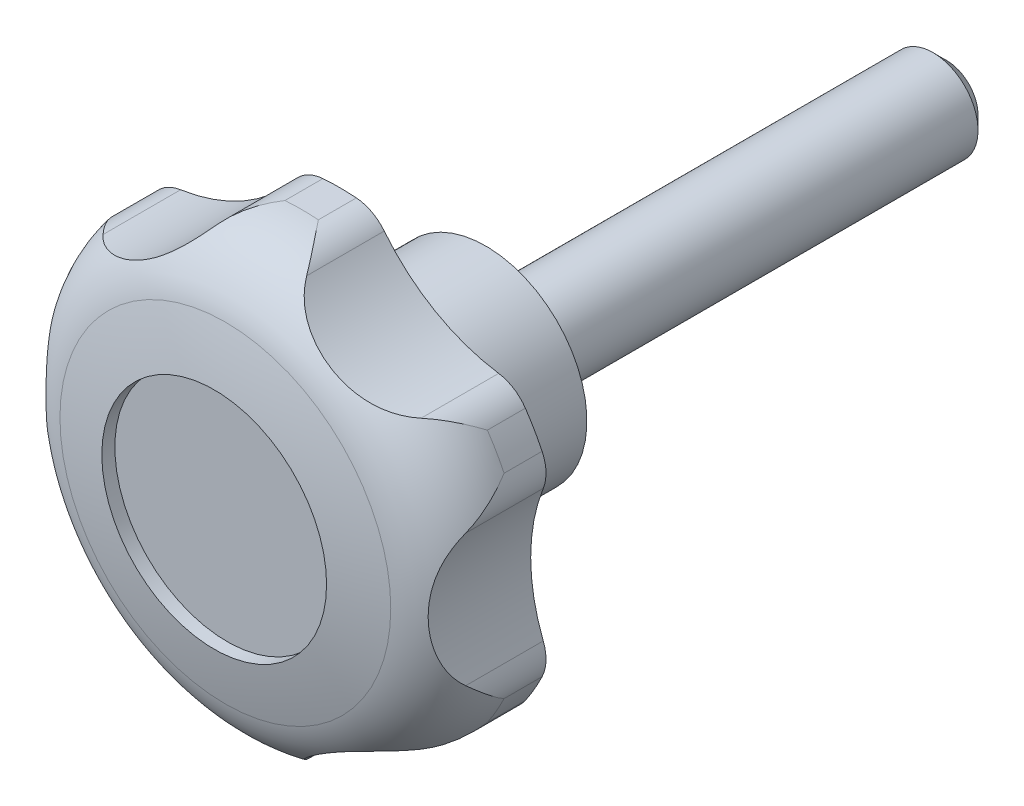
ISO-10303-21;
HEADER;
FILE_DESCRIPTION(('STEP AP214'),'2;1');
FILE_NAME('part.step','',(''),(''),'','','');
FILE_SCHEMA(('AUTOMOTIVE_DESIGN { 1 0 10303 214 1 1 1 1 }'));
ENDSEC;
DATA;
#1=APPLICATION_CONTEXT('core data for automotive mechanical design processes');
#2=APPLICATION_PROTOCOL_DEFINITION('international standard','automotive_design',2000,#1);
#3=PRODUCT_CONTEXT('',#1,'mechanical');
#4=PRODUCT('Part','Part','',(#3));
#5=PRODUCT_RELATED_PRODUCT_CATEGORY('part','',(#4));
#6=PRODUCT_DEFINITION_FORMATION('','',#4);
#7=PRODUCT_DEFINITION_CONTEXT('part definition',#1,'design');
#8=PRODUCT_DEFINITION('design','',#6,#7);
#9=PRODUCT_DEFINITION_SHAPE('','',#8);
#10=(LENGTH_UNIT() NAMED_UNIT(*) SI_UNIT(.MILLI.,.METRE.));
#11=(NAMED_UNIT(*) PLANE_ANGLE_UNIT() SI_UNIT($,.RADIAN.));
#12=(NAMED_UNIT(*) SI_UNIT($,.STERADIAN.) SOLID_ANGLE_UNIT());
#13=UNCERTAINTY_MEASURE_WITH_UNIT(LENGTH_MEASURE(1.E-05),#10,'distance_accuracy_value','');
#14=(GEOMETRIC_REPRESENTATION_CONTEXT(3) GLOBAL_UNCERTAINTY_ASSIGNED_CONTEXT((#13)) GLOBAL_UNIT_ASSIGNED_CONTEXT((#10,
#11,#12)) REPRESENTATION_CONTEXT('',''));
#15=CARTESIAN_POINT('',(0.,0.,0.));
#16=DIRECTION('',(0.,0.,1.));
#17=DIRECTION('',(1.,0.,0.));
#18=AXIS2_PLACEMENT_3D('',#15,#16,#17);
#19=CARTESIAN_POINT('',(0.,0.,-34.0000000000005));
#20=DIRECTION('',(-1.,0.,0.));
#21=DIRECTION('',(0.,0.,-1.));
#22=AXIS2_PLACEMENT_3D('',#19,#20,#21);
#23=SPHERICAL_SURFACE('',#22,60.);
#24=CARTESIAN_POINT('',(0.,0.,-34.0000000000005));
#25=DIRECTION('',(0.,0.,1.));
#26=DIRECTION('',(-1.,0.,0.));
#27=AXIS2_PLACEMENT_3D('',#24,#25,#26);
#28=SPHERICAL_SURFACE('',#27,60.);
#29=CARTESIAN_POINT('',(0.,0.,24.167090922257));
#30=DIRECTION('',(0.,0.,1.));
#31=DIRECTION('',(-1.,0.,0.));
#32=AXIS2_PLACEMENT_3D('',#29,#30,#31);
#33=CIRCLE('',#32,14.7169811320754);
#34=CARTESIAN_POINT('',(-14.7169811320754,0.,24.167090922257));
#35=VERTEX_POINT('',#34);
#36=EDGE_CURVE('E682',#35,#35,#33,.T.);
#37=ORIENTED_EDGE('',*,*,#36,.T.);
#38=EDGE_LOOP('',(#37));
#39=FACE_BOUND('',#38,.T.);
#40=CARTESIAN_POINT('',(0.,0.,25.160797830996));
#41=DIRECTION('',(0.,0.,-1.));
#42=DIRECTION('',(1.,0.,0.));
#43=AXIS2_PLACEMENT_3D('',#40,#41,#42);
#44=CIRCLE('',#43,10.);
#45=CARTESIAN_POINT('',(10.,0.,25.160797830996));
#46=VERTEX_POINT('',#45);
#47=EDGE_CURVE('E191',#46,#46,#44,.T.);
#48=ORIENTED_EDGE('',*,*,#47,.T.);
#49=EDGE_LOOP('',(#48));
#50=FACE_BOUND('',#49,.T.);
#51=ADVANCED_FACE('F14',(#39,#50),#28,.T.);
#52=CARTESIAN_POINT('',(0.,0.,32.5455656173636));
#53=DIRECTION('',(0.,0.,1.));
#54=DIRECTION('',(-1.,0.,0.));
#55=AXIS2_PLACEMENT_3D('',#52,#53,#54);
#56=CYLINDRICAL_SURFACE('',#55,20.);
#57=CARTESIAN_POINT('',(0.,0.,14.));
#58=DIRECTION('',(0.,0.,1.));
#59=DIRECTION('',(-1.,0.,0.));
#60=AXIS2_PLACEMENT_3D('',#57,#58,#59);
#61=CIRCLE('',#60,20.);
#62=CARTESIAN_POINT('',(1.4880574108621,19.9445653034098,13.9999999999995));
#63=VERTEX_POINT('',#62);
#64=CARTESIAN_POINT('',(-1.48805741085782,19.94456530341,13.9999999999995));
#65=VERTEX_POINT('',#64);
#66=EDGE_CURVE('E470',#63,#65,#61,.T.);
#67=ORIENTED_EDGE('',*,*,#66,.T.);
#68=DIRECTION('',(0.,0.,1.));
#69=VECTOR('',#68,1.);
#70=CARTESIAN_POINT('',(-1.48805741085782,19.94456530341,-39.));
#71=LINE('',#70,#69);
#72=CARTESIAN_POINT('',(-1.48805741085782,19.94456530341,17.38093031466));
#73=VERTEX_POINT('',#72);
#74=EDGE_CURVE('E182',#65,#73,#71,.T.);
#75=ORIENTED_EDGE('',*,*,#74,.T.);
#76=CARTESIAN_POINT('',(0.,0.,17.38093031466));
#77=DIRECTION('',(0.,0.,1.));
#78=DIRECTION('',(-1.,0.,0.));
#79=AXIS2_PLACEMENT_3D('',#76,#77,#78);
#80=CIRCLE('',#79,20.);
#81=CARTESIAN_POINT('',(1.4880574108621,19.9445653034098,17.38093031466));
#82=VERTEX_POINT('',#81);
#83=EDGE_CURVE('E198',#82,#73,#80,.T.);
#84=ORIENTED_EDGE('',*,*,#83,.F.);
#85=DIRECTION('',(0.,0.,1.));
#86=VECTOR('',#85,1.);
#87=CARTESIAN_POINT('',(1.4880574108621,19.9445653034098,-39.));
#88=LINE('',#87,#86);
#89=EDGE_CURVE('E637',#63,#82,#88,.T.);
#90=ORIENTED_EDGE('',*,*,#89,.F.);
#91=EDGE_LOOP('',(#67,#75,#84,#90));
#92=FACE_BOUND('',#91,.T.);
#93=ADVANCED_FACE('F437',(#92),#56,.T.);
#94=CARTESIAN_POINT('',(18.0165289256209,8.68358713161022,13.9999999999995));
#95=VERTEX_POINT('',#94);
#96=CARTESIAN_POINT('',(16.5284715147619,11.2609781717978,14.));
#97=VERTEX_POINT('',#96);
#98=EDGE_CURVE('E474',#95,#97,#61,.T.);
#99=ORIENTED_EDGE('',*,*,#98,.T.);
#100=DIRECTION('',(0.,0.,1.));
#101=VECTOR('',#100,1.);
#102=CARTESIAN_POINT('',(16.5284715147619,11.2609781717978,-39.));
#103=LINE('',#102,#101);
#104=CARTESIAN_POINT('',(16.5284715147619,11.2609781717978,17.38093031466));
#105=VERTEX_POINT('',#104);
#106=EDGE_CURVE('E502',#97,#105,#103,.T.);
#107=ORIENTED_EDGE('',*,*,#106,.T.);
#108=CARTESIAN_POINT('',(18.0165289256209,8.68358713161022,17.38093031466));
#109=VERTEX_POINT('',#108);
#110=EDGE_CURVE('E675',#109,#105,#80,.T.);
#111=ORIENTED_EDGE('',*,*,#110,.F.);
#112=DIRECTION('',(0.,0.,1.));
#113=VECTOR('',#112,1.);
#114=CARTESIAN_POINT('',(18.0165289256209,8.68358713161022,-39.));
#115=LINE('',#114,#113);
#116=EDGE_CURVE('E504',#95,#109,#115,.T.);
#117=ORIENTED_EDGE('',*,*,#116,.F.);
#118=EDGE_LOOP('',(#99,#107,#111,#117));
#119=FACE_BOUND('',#118,.T.);
#120=ADVANCED_FACE('F439',(#119),#56,.T.);
#121=CARTESIAN_POINT('',(16.5284715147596,-11.260978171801,13.9999999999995));
#122=VERTEX_POINT('',#121);
#123=CARTESIAN_POINT('',(18.0165289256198,-8.68358713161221,14.));
#124=VERTEX_POINT('',#123);
#125=EDGE_CURVE('E487',#122,#124,#61,.T.);
#126=ORIENTED_EDGE('',*,*,#125,.T.);
#127=DIRECTION('',(0.,0.,1.));
#128=VECTOR('',#127,1.);
#129=CARTESIAN_POINT('',(18.0165289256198,-8.68358713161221,-39.));
#130=LINE('',#129,#128);
#131=CARTESIAN_POINT('',(18.0165289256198,-8.68358713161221,17.38093031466));
#132=VERTEX_POINT('',#131);
#133=EDGE_CURVE('E623',#124,#132,#130,.T.);
#134=ORIENTED_EDGE('',*,*,#133,.T.);
#135=CARTESIAN_POINT('',(16.5284715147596,-11.260978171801,17.38093031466));
#136=VERTEX_POINT('',#135);
#137=EDGE_CURVE('E677',#136,#132,#80,.T.);
#138=ORIENTED_EDGE('',*,*,#137,.F.);
#139=DIRECTION('',(0.,0.,1.));
#140=VECTOR('',#139,1.);
#141=CARTESIAN_POINT('',(16.5284715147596,-11.260978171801,-39.));
#142=LINE('',#141,#140);
#143=EDGE_CURVE('E621',#122,#136,#142,.T.);
#144=ORIENTED_EDGE('',*,*,#143,.F.);
#145=EDGE_LOOP('',(#126,#134,#138,#144));
#146=FACE_BOUND('',#145,.T.);
#147=ADVANCED_FACE('F448',(#146),#56,.T.);
#148=CARTESIAN_POINT('',(-1.48805741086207,-19.9445653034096,13.9999999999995));
#149=VERTEX_POINT('',#148);
#150=CARTESIAN_POINT('',(1.48805741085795,-19.94456530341,14.));
#151=VERTEX_POINT('',#150);
#152=EDGE_CURVE('E481',#149,#151,#61,.T.);
#153=ORIENTED_EDGE('',*,*,#152,.T.);
#154=DIRECTION('',(0.,0.,1.));
#155=VECTOR('',#154,1.);
#156=CARTESIAN_POINT('',(1.48805741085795,-19.94456530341,-39.));
#157=LINE('',#156,#155);
#158=CARTESIAN_POINT('',(1.48805741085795,-19.94456530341,17.38093031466));
#159=VERTEX_POINT('',#158);
#160=EDGE_CURVE('E613',#151,#159,#157,.T.);
#161=ORIENTED_EDGE('',*,*,#160,.T.);
#162=CARTESIAN_POINT('',(-1.48805741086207,-19.9445653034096,17.38093031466));
#163=VERTEX_POINT('',#162);
#164=EDGE_CURVE('E679',#163,#159,#80,.T.);
#165=ORIENTED_EDGE('',*,*,#164,.F.);
#166=DIRECTION('',(0.,0.,1.));
#167=VECTOR('',#166,1.);
#168=CARTESIAN_POINT('',(-1.48805741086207,-19.9445653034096,-39.));
#169=LINE('',#168,#167);
#170=EDGE_CURVE('E611',#149,#163,#169,.T.);
#171=ORIENTED_EDGE('',*,*,#170,.F.);
#172=EDGE_LOOP('',(#153,#161,#165,#171));
#173=FACE_BOUND('',#172,.T.);
#174=ADVANCED_FACE('F460',(#173),#56,.T.);
#175=CARTESIAN_POINT('',(-18.0165289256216,-8.68358713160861,13.9999999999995));
#176=VERTEX_POINT('',#175);
#177=CARTESIAN_POINT('',(-16.5284715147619,-11.2609781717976,14.));
#178=VERTEX_POINT('',#177);
#179=EDGE_CURVE('E473',#176,#178,#61,.T.);
#180=ORIENTED_EDGE('',*,*,#179,.T.);
#181=DIRECTION('',(0.,0.,1.));
#182=VECTOR('',#181,1.);
#183=CARTESIAN_POINT('',(-16.5284715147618,-11.2609781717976,-39.));
#184=LINE('',#183,#182);
#185=CARTESIAN_POINT('',(-16.5284715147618,-11.2609781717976,17.38093031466));
#186=VERTEX_POINT('',#185);
#187=EDGE_CURVE('E603',#178,#186,#184,.T.);
#188=ORIENTED_EDGE('',*,*,#187,.T.);
#189=CARTESIAN_POINT('',(-18.0165289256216,-8.68358713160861,17.38093031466));
#190=VERTEX_POINT('',#189);
#191=EDGE_CURVE('E485',#190,#186,#80,.T.);
#192=ORIENTED_EDGE('',*,*,#191,.F.);
#193=DIRECTION('',(0.,0.,1.));
#194=VECTOR('',#193,1.);
#195=CARTESIAN_POINT('',(-18.0165289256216,-8.68358713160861,-39.));
#196=LINE('',#195,#194);
#197=EDGE_CURVE('E601',#176,#190,#196,.T.);
#198=ORIENTED_EDGE('',*,*,#197,.F.);
#199=EDGE_LOOP('',(#180,#188,#192,#198));
#200=FACE_BOUND('',#199,.T.);
#201=ADVANCED_FACE('F453',(#200),#56,.T.);
#202=CARTESIAN_POINT('',(-16.5284715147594,11.2609781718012,13.9999999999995));
#203=VERTEX_POINT('',#202);
#204=CARTESIAN_POINT('',(-18.0165289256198,8.68358713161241,14.));
#205=VERTEX_POINT('',#204);
#206=EDGE_CURVE('E465',#203,#205,#61,.T.);
#207=ORIENTED_EDGE('',*,*,#206,.T.);
#208=DIRECTION('',(0.,0.,1.));
#209=VECTOR('',#208,1.);
#210=CARTESIAN_POINT('',(-18.0165289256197,8.68358713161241,-39.));
#211=LINE('',#210,#209);
#212=CARTESIAN_POINT('',(-18.0165289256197,8.68358713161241,17.38093031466));
#213=VERTEX_POINT('',#212);
#214=EDGE_CURVE('E37',#205,#213,#211,.T.);
#215=ORIENTED_EDGE('',*,*,#214,.T.);
#216=CARTESIAN_POINT('',(-16.5284715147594,11.2609781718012,17.38093031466));
#217=VERTEX_POINT('',#216);
#218=EDGE_CURVE('E480',#217,#213,#80,.T.);
#219=ORIENTED_EDGE('',*,*,#218,.F.);
#220=DIRECTION('',(0.,0.,1.));
#221=VECTOR('',#220,1.);
#222=CARTESIAN_POINT('',(-16.5284715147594,11.2609781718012,-39.));
#223=LINE('',#222,#221);
#224=EDGE_CURVE('E468',#203,#217,#223,.T.);
#225=ORIENTED_EDGE('',*,*,#224,.F.);
#226=EDGE_LOOP('',(#207,#215,#219,#225));
#227=FACE_BOUND('',#226,.T.);
#228=ADVANCED_FACE('F441',(#227),#56,.T.);
#229=CARTESIAN_POINT('',(0.,0.,17.38093031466));
#230=DIRECTION('',(0.,0.,1.));
#231=DIRECTION('',(-1.,0.,0.));
#232=AXIS2_PLACEMENT_3D('',#229,#230,#231);
#233=TOROIDAL_SURFACE('',#232,13.,7.);
#234=CARTESIAN_POINT('',(1.48805741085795,19.94456530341,17.38093031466));
#235=CARTESIAN_POINT('',(1.49147422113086,19.9443103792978,17.3853314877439));
#236=CARTESIAN_POINT('',(1.49489072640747,19.9440504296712,17.3897327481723));
#237=CARTESIAN_POINT('',(1.81379375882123,19.9193149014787,17.8006005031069));
#238=CARTESIAN_POINT('',(2.12658065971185,19.8519874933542,18.20777523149));
#239=CARTESIAN_POINT('',(2.72890668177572,19.632187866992,19.0173039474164));
#240=CARTESIAN_POINT('',(3.01841511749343,19.4796053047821,19.4196509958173));
#241=CARTESIAN_POINT('',(3.41111362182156,19.1940432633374,20.000662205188));
#242=CARTESIAN_POINT('',(3.53138560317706,19.0939385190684,20.1842811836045));
#243=CARTESIAN_POINT('',(3.75978456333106,18.8756523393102,20.5475677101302));
#244=CARTESIAN_POINT('',(3.86793749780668,18.7575108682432,20.7272430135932));
#245=CARTESIAN_POINT('',(3.96899762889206,18.6302715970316,20.9047576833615));
#246=B_SPLINE_CURVE_WITH_KNOTS('',3,(#234,#235,#236,#237,#238,#239,#240,#241,#242,#243,#244,
#245),.UNSPECIFIED.,.F.,.F.,(4,2,2,2,2,4),(0.,0.0167332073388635,1.56205380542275,
3.10937912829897,3.83223807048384,4.55351799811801),.UNSPECIFIED.);
#247=CARTESIAN_POINT('',(3.96883886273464,18.6304715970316,20.9044786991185));
#248=VERTEX_POINT('',#247);
#249=EDGE_CURVE('E200',#82,#248,#246,.T.);
#250=ORIENTED_EDGE('',*,*,#249,.F.);
#251=ORIENTED_EDGE('',*,*,#83,.T.);
#252=CARTESIAN_POINT('',(-3.96899762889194,18.6302715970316,20.9047576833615));
#253=CARTESIAN_POINT('',(-3.87488306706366,18.7487894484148,20.7394301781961));
#254=CARTESIAN_POINT('',(-3.77455997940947,18.859445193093,20.5721519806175));
#255=CARTESIAN_POINT('',(-3.56354943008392,19.0648747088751,20.234567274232));
#256=CARTESIAN_POINT('',(-3.45286825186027,19.159658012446,20.064262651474));
#257=CARTESIAN_POINT('',(-3.22337066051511,19.3331052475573,19.7217368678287));
#258=CARTESIAN_POINT('',(-3.10457584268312,19.4118099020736,19.5495217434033));
#259=CARTESIAN_POINT('',(-2.86030415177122,19.5533565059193,19.2033602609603));
#260=CARTESIAN_POINT('',(-2.73482744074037,19.6161988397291,19.0294139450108));
#261=CARTESIAN_POINT('',(-2.42924956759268,19.7472078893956,18.6128190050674));
#262=CARTESIAN_POINT('',(-2.24677265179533,19.8080525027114,18.3695899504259));
#263=CARTESIAN_POINT('',(-1.87597960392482,19.8989790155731,17.8822329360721));
#264=CARTESIAN_POINT('',(-1.68767071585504,19.9290976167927,17.6381063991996));
#265=CARTESIAN_POINT('',(-1.49489075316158,19.9440504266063,17.3897327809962));
#266=CARTESIAN_POINT('',(-1.49147424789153,19.9443103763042,17.3853315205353));
#267=CARTESIAN_POINT('',(-1.48805741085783,19.94456530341,17.38093031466));
#268=B_SPLINE_CURVE_WITH_KNOTS('',3,(#252,#253,#254,#255,#256,#257,#258,#259,#260,#261,#262,
#263,#264,#265,#266,#267),.UNSPECIFIED.,.F.,.F.,(4,2,2,2,2,2,2,4),(0.,0.672016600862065,
1.34362815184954,2.01351700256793,2.68338961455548,3.61205098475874,4.53960178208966,
4.55633498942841),.UNSPECIFIED.);
#269=CARTESIAN_POINT('',(-3.96883886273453,18.6304715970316,20.9044786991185));
#270=VERTEX_POINT('',#269);
#271=EDGE_CURVE('E186',#270,#73,#268,.T.);
#272=ORIENTED_EDGE('',*,*,#271,.F.);
#273=CARTESIAN_POINT('',(-3.96868008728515,18.6306715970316,20.9041996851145));
#274=CARTESIAN_POINT('',(-4.04437009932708,18.5352984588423,21.0373324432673));
#275=CARTESIAN_POINT('',(-4.12526413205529,18.4356613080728,21.1643450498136));
#276=CARTESIAN_POINT('',(-4.29682494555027,18.2299121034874,21.4055808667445));
#277=CARTESIAN_POINT('',(-4.3874794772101,18.1238082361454,21.5198197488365));
#278=CARTESIAN_POINT('',(-4.57713747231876,17.9080462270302,21.734184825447));
#279=CARTESIAN_POINT('',(-4.67604562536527,17.7984357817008,21.8344439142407));
#280=CARTESIAN_POINT('',(-4.8823807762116,17.5763891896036,22.0223145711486));
#281=CARTESIAN_POINT('',(-4.98981004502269,17.4639522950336,22.1099227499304));
#282=CARTESIAN_POINT('',(-5.21195811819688,17.2384215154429,22.2724206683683));
#283=CARTESIAN_POINT('',(-5.32664134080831,17.1253329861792,22.3473667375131));
#284=CARTESIAN_POINT('',(-5.56302161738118,16.8994018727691,22.4855727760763));
#285=CARTESIAN_POINT('',(-5.68471815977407,16.7865592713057,22.5488335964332));
#286=CARTESIAN_POINT('',(-5.93480326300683,16.5619776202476,22.664519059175));
#287=CARTESIAN_POINT('',(-6.06320974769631,16.4502425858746,22.716912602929));
#288=CARTESIAN_POINT('',(-6.32576627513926,16.2291643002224,22.8113760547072));
#289=CARTESIAN_POINT('',(-6.45991755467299,16.1198215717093,22.8534437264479));
#290=CARTESIAN_POINT('',(-6.79339160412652,15.8570291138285,22.9443164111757));
#291=CARTESIAN_POINT('',(-6.9954768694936,15.7052831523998,22.9879752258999));
#292=CARTESIAN_POINT('',(-7.40871955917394,15.410195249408,23.0571569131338));
#293=CARTESIAN_POINT('',(-7.61988028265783,15.2668564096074,23.0826731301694));
#294=CARTESIAN_POINT('',(-8.05020035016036,14.9896326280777,23.1167506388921));
#295=CARTESIAN_POINT('',(-8.26937403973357,14.8557660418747,23.1252798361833));
#296=CARTESIAN_POINT('',(-8.71390124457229,14.59876043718,23.1256982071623));
#297=CARTESIAN_POINT('',(-8.93925403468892,14.4756201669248,23.1175893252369));
#298=CARTESIAN_POINT('',(-9.39691071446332,14.2396244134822,23.0841784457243));
#299=CARTESIAN_POINT('',(-9.62926146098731,14.1268834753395,23.0587061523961));
#300=CARTESIAN_POINT('',(-10.0969036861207,13.9136966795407,22.9891901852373));
#301=CARTESIAN_POINT('',(-10.3321956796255,13.813253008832,22.9451432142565));
#302=CARTESIAN_POINT('',(-10.8026152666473,13.6254517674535,22.8367845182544));
#303=CARTESIAN_POINT('',(-11.0377415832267,13.5380595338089,22.7725279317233));
#304=CARTESIAN_POINT('',(-11.5052304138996,13.37642671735,22.6215210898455));
#305=CARTESIAN_POINT('',(-11.7375946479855,13.3021775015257,22.5347856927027));
#306=CARTESIAN_POINT('',(-12.1176745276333,13.1898767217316,22.3703811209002));
#307=CARTESIAN_POINT('',(-12.2673166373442,13.1480997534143,22.2996511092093));
#308=CARTESIAN_POINT('',(-12.5622706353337,13.0702110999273,22.1469698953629));
#309=CARTESIAN_POINT('',(-12.7075838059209,13.0340977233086,22.0650220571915));
#310=CARTESIAN_POINT('',(-12.992062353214,12.967442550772,21.8897703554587));
#311=CARTESIAN_POINT('',(-13.1312411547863,12.9368880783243,21.7964931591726));
#312=CARTESIAN_POINT('',(-13.4021505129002,12.880989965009,21.5983767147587));
#313=CARTESIAN_POINT('',(-13.5338850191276,12.8556435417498,21.4935436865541));
#314=CARTESIAN_POINT('',(-13.7470664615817,12.817207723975,21.3083350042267));
#315=CARTESIAN_POINT('',(-13.8309740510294,12.8028082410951,21.2310445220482));
#316=CARTESIAN_POINT('',(-13.9941817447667,12.7760624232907,21.0714083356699));
#317=CARTESIAN_POINT('',(-14.0734817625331,12.7637161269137,20.9890625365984));
#318=CARTESIAN_POINT('',(-14.1502422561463,12.7523213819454,20.9042577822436));
#319=B_SPLINE_CURVE_WITH_KNOTS('',3,(#273,#274,#275,#276,#277,#278,#279,#280,#281,#282,#283,
#284,#285,#286,#287,#288,#289,#290,#291,#292,#293,#294,#295,#296,#297,#298,#299,#300,#301,#302,
#303,#304,#305,#306,#307,#308,#309,#310,#311,#312,#313,#314,#315,#316,#317,#318),.UNSPECIFIED.,
.F.,.F.,(4,2,2,2,2,2,2,2,2,2,2,2,2,2,2,2,2,2,2,2,2,2,4),(0.,0.540904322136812,1.08113756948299,
1.61582234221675,2.1506500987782,2.6830320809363,3.215375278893,3.74922146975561,
4.28318317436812,5.05149336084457,5.82008525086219,6.59012790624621,7.36008057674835,
8.13769549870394,8.91544851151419,9.69109770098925,10.4662354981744,10.9779030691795,
11.4894175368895,11.9997505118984,12.5098101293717,12.8545587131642,13.1993137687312),.UNSPECIFIED.);
#320=CARTESIAN_POINT('',(-14.1500422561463,12.752351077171,20.9044786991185));
#321=VERTEX_POINT('',#320);
#322=EDGE_CURVE('E174',#270,#321,#319,.T.);
#323=ORIENTED_EDGE('',*,*,#322,.T.);
#324=CARTESIAN_POINT('',(-16.5284715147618,11.2609781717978,17.38093031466));
#325=CARTESIAN_POINT('',(-16.5265423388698,11.2638097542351,17.3853314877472));
#326=CARTESIAN_POINT('',(-16.5246089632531,11.2666385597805,17.3897327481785));
#327=CARTESIAN_POINT('',(-16.3437358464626,11.5304489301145,17.8006005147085));
#328=CARTESIAN_POINT('',(-16.1290351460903,11.7676666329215,18.2077752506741));
#329=CARTESIAN_POINT('',(-15.6375200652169,12.1793964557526,19.0173039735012));
#330=CARTESIAN_POINT('',(-15.360625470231,12.3538268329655,19.4196510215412));
#331=CARTESIAN_POINT('',(-14.9169799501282,12.5511292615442,20.0006521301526));
#332=CARTESIAN_POINT('',(-14.7701590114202,12.6052330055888,20.1842611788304));
#333=CARTESIAN_POINT('',(-14.4669357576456,12.69388650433,20.547528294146));
#334=CARTESIAN_POINT('',(-14.3105550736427,12.7284787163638,20.727194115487));
#335=CARTESIAN_POINT('',(-14.1498422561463,12.7523807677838,20.904699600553));
#336=B_SPLINE_CURVE_WITH_KNOTS('',3,(#324,#325,#326,#327,#328,#329,#330,#331,#332,#333,#334,
#335),.UNSPECIFIED.,.F.,.F.,(4,2,2,2,2,4),(0.,0.0167332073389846,1.56205384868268,
3.10937912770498,3.83219873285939,4.5534393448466),.UNSPECIFIED.);
#337=EDGE_CURVE('E181',#217,#321,#336,.T.);
#338=ORIENTED_EDGE('',*,*,#337,.F.);
#339=ORIENTED_EDGE('',*,*,#218,.T.);
#340=CARTESIAN_POINT('',(-18.1188021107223,5.8779205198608,20.904713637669));
#341=CARTESIAN_POINT('',(-18.1743828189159,6.01868604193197,20.7393849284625));
#342=CARTESIAN_POINT('',(-18.2200504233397,6.16089717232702,20.5721055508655));
#343=CARTESIAN_POINT('',(-18.2924491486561,6.4463540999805,20.2345185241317));
#344=CARTESIAN_POINT('',(-18.3191916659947,6.58959922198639,20.0642127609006));
#345=CARTESIAN_POINT('',(-18.3546491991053,6.87507491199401,19.7216847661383));
#346=CARTESIAN_POINT('',(-18.3634102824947,7.01730713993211,19.5494685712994));
#347=CARTESIAN_POINT('',(-18.3638538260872,7.29962689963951,19.2033049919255));
#348=CARTESIAN_POINT('',(-18.3555367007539,7.43971448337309,19.0293576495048));
#349=CARTESIAN_POINT('',(-18.3162014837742,7.76984941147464,18.612771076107));
#350=CARTESIAN_POINT('',(-18.2776557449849,7.95829337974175,18.3695515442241));
#351=CARTESIAN_POINT('',(-18.1710057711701,8.3248575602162,17.8822136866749));
#352=CARTESIAN_POINT('',(-18.1029369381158,8.50298984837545,17.638096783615));
#353=CARTESIAN_POINT('',(-18.0194997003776,8.67741184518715,17.3897327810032));
#354=CARTESIAN_POINT('',(-18.018016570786,8.68050060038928,17.3853315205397));
#355=CARTESIAN_POINT('',(-18.0165289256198,8.68358713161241,17.38093031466));
#356=B_SPLINE_CURVE_WITH_KNOTS('',3,(#340,#341,#342,#343,#344,#345,#346,#347,#348,#349,#350,
#351,#352,#353,#354,#355),.UNSPECIFIED.,.F.,.F.,(4,2,2,2,2,2,2,4),(0.,0.672020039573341,
1.34363505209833,2.01352725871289,2.6834032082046,3.61202792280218,4.5395421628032,
4.55627537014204),.UNSPECIFIED.);
#357=CARTESIAN_POINT('',(-18.1188811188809,5.87812051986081,20.9044786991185));
#358=VERTEX_POINT('',#357);
#359=EDGE_CURVE('E248',#358,#213,#356,.T.);
#360=ORIENTED_EDGE('',*,*,#359,.F.);
#361=CARTESIAN_POINT('',(-18.1189601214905,5.8783205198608,20.9042437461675));
#362=CARTESIAN_POINT('',(-18.0742090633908,5.76508237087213,21.0373759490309));
#363=CARTESIAN_POINT('',(-18.0283673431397,5.64520539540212,21.1643878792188));
#364=CARTESIAN_POINT('',(-17.9359630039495,5.393750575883,21.4056221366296));
#365=CARTESIAN_POINT('',(-17.8894013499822,5.26218743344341,21.5198601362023));
#366=CARTESIAN_POINT('',(-17.7973745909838,4.99005371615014,21.73422328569));
#367=CARTESIAN_POINT('',(-17.7519031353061,4.84958953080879,21.8344813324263));
#368=CARTESIAN_POINT('',(-17.6627726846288,4.55987085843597,22.0223497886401));
#369=CARTESIAN_POINT('',(-17.6191141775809,4.41061403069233,22.1099568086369));
#370=CARTESIAN_POINT('',(-17.5348731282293,4.10545908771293,22.2724523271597));
#371=CARTESIAN_POINT('',(-17.4942774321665,3.9495944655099,22.3473971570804));
#372=CARTESIAN_POINT('',(-17.4168061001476,3.63191414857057,22.4856006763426));
#373=CARTESIAN_POINT('',(-17.3799301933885,3.47009888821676,22.54886021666));
#374=CARTESIAN_POINT('',(-17.3104802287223,3.14122478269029,22.6645431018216));
#375=CARTESIAN_POINT('',(-17.2779186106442,2.97415242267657,22.7169353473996));
#376=CARTESIAN_POINT('',(-17.2177386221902,2.63622963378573,22.8113961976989));
#377=CARTESIAN_POINT('',(-17.1901213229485,2.46537839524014,22.8534625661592));
#378=CARTESIAN_POINT('',(-17.1292751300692,2.04518192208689,22.9443320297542));
#379=CARTESIAN_POINT('',(-17.098903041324,1.7942962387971,22.9879889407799));
#380=CARTESIAN_POINT('',(-17.0499732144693,1.28887036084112,23.0571668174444));
#381=CARTESIAN_POINT('',(-17.0314198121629,1.03432885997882,23.0826811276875));
#382=CARTESIAN_POINT('',(-17.0064997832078,0.523045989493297,23.1167547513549));
#383=CARTESIAN_POINT('',(-17.0001562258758,0.266301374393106,23.1252819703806));
#384=CARTESIAN_POINT('',(-16.9998494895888,-0.247175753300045,23.125696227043));
#385=CARTESIAN_POINT('',(-17.0058848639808,-0.503908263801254,23.1175852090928));
#386=CARTESIAN_POINT('',(-17.0303381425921,-1.01825026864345,23.0841697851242));
#387=CARTESIAN_POINT('',(-17.0488786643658,-1.2758430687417,23.0586950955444));
#388=CARTESIAN_POINT('',(-17.098077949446,-1.78742757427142,22.9891739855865));
#389=CARTESIAN_POINT('',(-17.128738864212,-2.04141863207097,22.9451242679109));
#390=CARTESIAN_POINT('',(-17.2013113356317,-2.54271489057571,22.8367596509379));
#391=CARTESIAN_POINT('',(-17.2431922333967,-2.7900363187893,22.7724998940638));
#392=CARTESIAN_POINT('',(-17.3369616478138,-3.27570930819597,22.6214862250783));
#393=CARTESIAN_POINT('',(-17.3888435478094,-3.51406667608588,22.5347471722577));
#394=CARTESIAN_POINT('',(-17.4816300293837,-3.89937284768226,22.3703368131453));
#395=CARTESIAN_POINT('',(-17.5202715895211,-4.04985295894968,22.2996049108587));
#396=CARTESIAN_POINT('',(-17.6002956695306,-4.34423029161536,22.1469199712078));
#397=CARTESIAN_POINT('',(-17.6416773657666,-4.48812946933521,22.0649702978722));
#398=CARTESIAN_POINT('',(-17.7261917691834,-4.76781773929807,21.8897150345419));
#399=CARTESIAN_POINT('',(-17.769320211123,-4.90362479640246,21.796436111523));
#400=CARTESIAN_POINT('',(-17.8563654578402,-5.1661829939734,21.5983163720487));
#401=CARTESIAN_POINT('',(-17.9002818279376,-5.29293894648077,21.4934817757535));
#402=CARTESIAN_POINT('',(-17.9735824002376,-5.49676399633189,21.3082786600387));
#403=CARTESIAN_POINT('',(-18.0030624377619,-5.57661965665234,21.2309958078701));
#404=CARTESIAN_POINT('',(-18.0614968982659,-5.73131526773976,21.0713760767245));
#405=CARTESIAN_POINT('',(-18.0904513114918,-5.80615512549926,20.9890391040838));
#406=CARTESIAN_POINT('',(-18.1189601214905,-5.87832051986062,20.9042437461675));
#407=B_SPLINE_CURVE_WITH_KNOTS('',3,(#361,#362,#363,#364,#365,#366,#367,#368,#369,#370,#371,
#372,#373,#374,#375,#376,#377,#378,#379,#380,#381,#382,#383,#384,#385,#386,#387,#388,#389,#390,
#391,#392,#393,#394,#395,#396,#397,#398,#399,#400,#401,#402,#403,#404,#405,#406),.UNSPECIFIED.,
.F.,.F.,(4,2,2,2,2,2,2,2,2,2,2,2,2,2,2,2,2,2,2,2,2,2,4),(0.,0.540907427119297,1.08114375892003,
1.61583154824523,2.15066232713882,2.68304725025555,3.21539338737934,3.7492425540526,
4.28320723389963,5.05152112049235,5.82011670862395,6.59016306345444,7.3601194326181,
8.13773742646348,8.91549351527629,9.69114566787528,10.4662863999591,10.9779506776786,
11.4894618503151,11.9997915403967,12.5098478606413,12.8545572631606,13.199273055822),.UNSPECIFIED.);
#408=CARTESIAN_POINT('',(-18.1188811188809,-5.87812051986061,20.9044786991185));
#409=VERTEX_POINT('',#408);
#410=EDGE_CURVE('E254',#358,#409,#407,.T.);
#411=ORIENTED_EDGE('',*,*,#410,.T.);
#412=CARTESIAN_POINT('',(-18.0165289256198,-8.68358713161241,17.38093031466));
#413=CARTESIAN_POINT('',(-18.0180165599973,-8.68050062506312,17.3853314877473));
#414=CARTESIAN_POINT('',(-18.0194996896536,-8.67741186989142,17.3897327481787));
#415=CARTESIAN_POINT('',(-18.1575296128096,-8.38886597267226,17.8006005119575));
#416=CARTESIAN_POINT('',(-18.2556158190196,-8.08432086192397,18.2077752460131));
#417=CARTESIAN_POINT('',(-18.3664267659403,-7.45279140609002,19.0173039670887));
#418=CARTESIAN_POINT('',(-18.3790406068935,-7.12577846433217,19.4196510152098));
#419=CARTESIAN_POINT('',(-18.3280865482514,-6.64291693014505,20.0006545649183));
#420=CARTESIAN_POINT('',(-18.3015308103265,-6.48871235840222,20.184266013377));
#421=CARTESIAN_POINT('',(-18.226693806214,-6.18178255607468,20.5475378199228));
#422=CARTESIAN_POINT('',(-18.1784601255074,-6.02905482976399,20.7272059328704));
#423=CARTESIAN_POINT('',(-18.1188021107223,-5.87792051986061,20.904713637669));
#424=B_SPLINE_CURVE_WITH_KNOTS('',3,(#412,#413,#414,#415,#416,#417,#418,#419,#420,#421,#422,
#423),.UNSPECIFIED.,.F.,.F.,(4,2,2,2,2,4),(0.,0.0167332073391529,1.56205383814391,
3.1093791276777,3.83220823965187,4.55345835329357),.UNSPECIFIED.);
#425=EDGE_CURVE('E276',#190,#409,#424,.T.);
#426=ORIENTED_EDGE('',*,*,#425,.F.);
#427=ORIENTED_EDGE('',*,*,#191,.T.);
#428=CARTESIAN_POINT('',(-14.1498422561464,-12.7523807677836,20.9046996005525));
#429=CARTESIAN_POINT('',(-14.2995391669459,-12.7301317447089,20.739370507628));
#430=CARTESIAN_POINT('',(-14.4455314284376,-12.6985749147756,20.5720907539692));
#431=CARTESIAN_POINT('',(-14.7289436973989,-12.6185444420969,20.23450298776));
#432=CARTESIAN_POINT('',(-14.8663688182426,-12.5700810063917,20.0641968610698));
#433=CARTESIAN_POINT('',(-15.1313266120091,-12.4580491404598,19.7216681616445));
#434=CARTESIAN_POINT('',(-15.2588837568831,-12.3945197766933,19.549451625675));
#435=CARTESIAN_POINT('',(-15.5036013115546,-12.2537428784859,19.2032873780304));
#436=CARTESIAN_POINT('',(-15.620761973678,-12.1764956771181,19.0293397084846));
#437=CARTESIAN_POINT('',(-15.8869968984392,-11.977363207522,18.6127558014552));
#438=CARTESIAN_POINT('',(-16.0309190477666,-11.8497608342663,18.3695393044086));
#439=CARTESIAN_POINT('',(-16.2950440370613,-11.5741201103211,17.8822075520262));
#440=CARTESIAN_POINT('',(-16.4152750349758,-11.4261063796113,17.6380937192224));
#441=CARTESIAN_POINT('',(-16.5246089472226,-11.2666385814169,17.3897327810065));
#442=CARTESIAN_POINT('',(-16.5265423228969,-11.2638097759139,17.3853315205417));
#443=CARTESIAN_POINT('',(-16.5284715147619,-11.2609781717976,17.38093031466));
#444=B_SPLINE_CURVE_WITH_KNOTS('',3,(#428,#429,#430,#431,#432,#433,#434,#435,#436,#437,#438,
#439,#440,#441,#442,#443),.UNSPECIFIED.,.F.,.F.,(4,2,2,2,2,2,2,4),(0.,0.672021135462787,
1.34363725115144,2.01353052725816,2.68340754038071,3.6120205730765,4.53952316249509,
4.5562563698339),.UNSPECIFIED.);
#445=CARTESIAN_POINT('',(-14.1500422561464,-12.7523510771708,20.9044786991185));
#446=VERTEX_POINT('',#445);
#447=EDGE_CURVE('E282',#446,#186,#444,.T.);
#448=ORIENTED_EDGE('',*,*,#447,.F.);
#449=CARTESIAN_POINT('',(-14.1502422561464,-12.7523213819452,20.9042577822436));
#450=CARTESIAN_POINT('',(-14.0297989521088,-12.7701850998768,21.0373898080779));
#451=CARTESIAN_POINT('',(-13.903060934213,-12.790423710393,21.1644015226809));
#452=CARTESIAN_POINT('',(-13.6390912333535,-12.8361270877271,21.4056352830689));
#453=CARTESIAN_POINT('',(-13.5018727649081,-12.8615853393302,21.519873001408));
#454=CARTESIAN_POINT('',(-13.2201834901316,-12.917955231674,21.7342355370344));
#455=CARTESIAN_POINT('',(-13.075801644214,-12.9488081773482,21.8344932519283));
#456=CARTESIAN_POINT('',(-12.7803316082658,-13.0164788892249,22.0223610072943));
#457=CARTESIAN_POINT('',(-12.6292416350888,-13.053298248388,22.1099676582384));
#458=CARTESIAN_POINT('',(-12.3228482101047,-13.1329214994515,22.2724624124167));
#459=CARTESIAN_POINT('',(-12.1675671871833,-13.1756972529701,22.3474068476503));
#460=CARTESIAN_POINT('',(-11.8537114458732,-13.2674459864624,22.4856095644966));
#461=CARTESIAN_POINT('',(-11.6951369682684,-13.3164185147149,22.5488686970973));
#462=CARTESIAN_POINT('',(-11.3755979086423,-13.420710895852,22.6645507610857));
#463=CARTESIAN_POINT('',(-11.2146278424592,-13.476048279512,22.7169425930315));
#464=CARTESIAN_POINT('',(-10.8918874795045,-13.5928930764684,22.8114026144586));
#465=CARTESIAN_POINT('',(-10.7301170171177,-13.6544018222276,22.8534685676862));
#466=CARTESIAN_POINT('',(-10.3357924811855,-13.8118067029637,22.9443370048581));
#467=CARTESIAN_POINT('',(-10.1033327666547,-13.9109471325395,22.9879933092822));
#468=CARTESIAN_POINT('',(-9.64115569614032,-14.1212867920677,23.05716997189));
#469=CARTESIAN_POINT('',(-9.41143937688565,-14.2324904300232,23.0826836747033));
#470=CARTESIAN_POINT('',(-8.95619505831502,-14.4665517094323,23.1167560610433));
#471=CARTESIAN_POINT('',(-8.73067578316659,-14.5894309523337,23.1252826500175));
#472=CARTESIAN_POINT('',(-8.28583797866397,-14.8459051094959,23.1256955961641));
#473=CARTESIAN_POINT('',(-8.06651872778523,-14.9794987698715,23.1175838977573));
#474=CARTESIAN_POINT('',(-7.63331213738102,-15.2578481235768,23.0841670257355));
#475=CARTESIAN_POINT('',(-7.41950056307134,-15.402701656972,23.0586915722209));
#476=CARTESIAN_POINT('',(-7.0010552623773,-15.7011028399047,22.9891688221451));
#477=CARTESIAN_POINT('',(-6.796423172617,-15.8546520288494,22.94511822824));
#478=CARTESIAN_POINT('',(-6.39857455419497,-16.1681507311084,22.8367517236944));
#479=CARTESIAN_POINT('',(-6.20532864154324,-16.328081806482,22.7724909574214));
#480=CARTESIAN_POINT('',(-5.83160887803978,-16.6521257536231,22.6214751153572));
#481=CARTESIAN_POINT('',(-5.65112668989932,-16.8162357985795,22.5347348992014));
#482=CARTESIAN_POINT('',(-5.36383637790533,-17.0892441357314,22.3703228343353));
#483=CARTESIAN_POINT('',(-5.25283846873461,-17.1979482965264,22.2995904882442));
#484=CARTESIAN_POINT('',(-5.03791406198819,-17.414438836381,22.1469047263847));
#485=CARTESIAN_POINT('',(-4.93398545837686,-17.5222254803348,22.0649546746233));
#486=CARTESIAN_POINT('',(-4.73402726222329,-17.7352600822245,21.8896987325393));
#487=CARTESIAN_POINT('',(-4.63797997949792,-17.8405133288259,21.796419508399));
#488=CARTESIAN_POINT('',(-4.45412221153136,-18.0471745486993,21.5982992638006));
#489=CARTESIAN_POINT('',(-4.36630734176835,-18.1485845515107,21.4934644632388));
#490=CARTESIAN_POINT('',(-4.22643837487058,-18.3139795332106,21.3082572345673));
#491=CARTESIAN_POINT('',(-4.17201918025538,-18.3794406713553,21.2309701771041));
#492=CARTESIAN_POINT('',(-4.06726211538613,-18.5073995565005,21.0713415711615));
#493=CARTESIAN_POINT('',(-4.01692432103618,-18.569897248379,20.9889999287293));
#494=CARTESIAN_POINT('',(-3.96868008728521,-18.6306715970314,20.904199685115));
#495=B_SPLINE_CURVE_WITH_KNOTS('',3,(#449,#450,#451,#452,#453,#454,#455,#456,#457,#458,#459,
#460,#461,#462,#463,#464,#465,#466,#467,#468,#469,#470,#471,#472,#473,#474,#475,#476,#477,#478,
#479,#480,#481,#482,#483,#484,#485,#486,#487,#488,#489,#490,#491,#492,#493,#494),.UNSPECIFIED.,
.F.,.F.,(4,2,2,2,2,2,2,2,2,2,2,2,2,2,2,2,2,2,2,2,2,2,4),(0.,0.540908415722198,1.08114572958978,
1.61583448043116,2.1506662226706,2.68305208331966,3.21539915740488,3.74924927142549,
4.28321489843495,5.05152996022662,5.82012672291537,6.59017425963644,7.36013181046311,
8.1377507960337,8.91550787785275,9.69116096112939,10.4663026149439,10.9779647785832,
11.4894738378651,11.9998014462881,12.5098556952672,12.8545815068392,13.1993137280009),.UNSPECIFIED.);
#496=CARTESIAN_POINT('',(-3.96883886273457,-18.6304715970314,20.9044786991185));
#497=VERTEX_POINT('',#496);
#498=EDGE_CURVE('E288',#446,#497,#495,.T.);
#499=ORIENTED_EDGE('',*,*,#498,.T.);
#500=CARTESIAN_POINT('',(-1.48805741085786,-19.94456530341,17.38093031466));
#501=CARTESIAN_POINT('',(-1.49147422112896,-19.9443103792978,17.3853314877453));
#502=CARTESIAN_POINT('',(-1.4948907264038,-19.9440504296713,17.389732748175));
#503=CARTESIAN_POINT('',(-1.81379375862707,-19.9193149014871,17.800600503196));
#504=CARTESIAN_POINT('',(-2.12658065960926,-19.8519874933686,18.2077752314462));
#505=CARTESIAN_POINT('',(-2.72890668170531,-19.6321878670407,19.0173039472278));
#506=CARTESIAN_POINT('',(-3.01841511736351,-19.4796053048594,19.419650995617));
#507=CARTESIAN_POINT('',(-3.41111362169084,-19.19404326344,20.000662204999));
#508=CARTESIAN_POINT('',(-3.5313856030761,-19.0939385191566,20.184281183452));
#509=CARTESIAN_POINT('',(-3.75978456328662,-18.8756523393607,20.5475677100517));
#510=CARTESIAN_POINT('',(-3.86793749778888,-18.7575108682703,20.7272430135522));
#511=CARTESIAN_POINT('',(-3.968997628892,-18.6302715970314,20.9047576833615));
#512=B_SPLINE_CURVE_WITH_KNOTS('',3,(#500,#501,#502,#503,#504,#505,#506,#507,#508,#509,#510,
#511),.UNSPECIFIED.,.F.,.F.,(4,2,2,2,2,4),(0.,0.0167332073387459,1.56205380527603,
3.10937912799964,3.83223807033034,4.55351799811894),.UNSPECIFIED.);
#513=EDGE_CURVE('E295',#163,#497,#512,.T.);
#514=ORIENTED_EDGE('',*,*,#513,.F.);
#515=ORIENTED_EDGE('',*,*,#164,.T.);
#516=CARTESIAN_POINT('',(3.96899762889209,-18.6302715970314,20.9047576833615));
#517=CARTESIAN_POINT('',(3.87488306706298,-18.748789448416,20.739430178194));
#518=CARTESIAN_POINT('',(3.77455997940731,-18.8594451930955,20.5721519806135));
#519=CARTESIAN_POINT('',(3.56354943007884,-19.0648747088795,20.2345672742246));
#520=CARTESIAN_POINT('',(3.45286825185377,-19.1596580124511,20.0642626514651));
#521=CARTESIAN_POINT('',(3.22337066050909,-19.3331052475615,19.7217368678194));
#522=CARTESIAN_POINT('',(3.10457584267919,-19.4118099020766,19.5495217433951));
#523=CARTESIAN_POINT('',(2.86030415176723,-19.5533565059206,19.2033602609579));
#524=CARTESIAN_POINT('',(2.73482744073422,-19.61619883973,19.0294139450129));
#525=CARTESIAN_POINT('',(2.42924956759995,-19.7472078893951,18.6128190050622));
#526=CARTESIAN_POINT('',(2.24677265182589,-19.8080525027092,18.369589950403));
#527=CARTESIAN_POINT('',(1.87597960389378,-19.8989790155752,17.8822329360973));
#528=CARTESIAN_POINT('',(1.68767071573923,-19.9290976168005,17.6381063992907));
#529=CARTESIAN_POINT('',(1.49489075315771,-19.9440504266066,17.3897327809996));
#530=CARTESIAN_POINT('',(1.49147424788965,-19.9443103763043,17.385331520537));
#531=CARTESIAN_POINT('',(1.48805741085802,-19.94456530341,17.38093031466));
#532=B_SPLINE_CURVE_WITH_KNOTS('',3,(#516,#517,#518,#519,#520,#521,#522,#523,#524,#525,#526,
#527,#528,#529,#530,#531),.UNSPECIFIED.,.F.,.F.,(4,2,2,2,2,2,2,4),(0.,0.672016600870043,
1.34362815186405,2.01351700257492,2.68338961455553,3.6120509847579,4.53960178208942,
4.55633498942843),.UNSPECIFIED.);
#533=CARTESIAN_POINT('',(3.96883886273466,-18.6304715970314,20.9044786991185));
#534=VERTEX_POINT('',#533);
#535=EDGE_CURVE('E319',#534,#159,#532,.T.);
#536=ORIENTED_EDGE('',*,*,#535,.F.);
#537=CARTESIAN_POINT('',(3.96868008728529,-18.6306715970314,20.9041996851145));
#538=CARTESIAN_POINT('',(4.04437009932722,-18.5352984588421,21.0373324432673));
#539=CARTESIAN_POINT('',(4.12526413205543,-18.4356613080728,21.1643450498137));
#540=CARTESIAN_POINT('',(4.29682494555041,-18.2299121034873,21.4055808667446));
#541=CARTESIAN_POINT('',(4.38747947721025,-18.1238082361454,21.5198197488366));
#542=CARTESIAN_POINT('',(4.5771374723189,-17.9080462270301,21.734184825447));
#543=CARTESIAN_POINT('',(4.67604562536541,-17.7984357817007,21.8344439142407));
#544=CARTESIAN_POINT('',(4.88238077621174,-17.5763891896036,22.0223145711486));
#545=CARTESIAN_POINT('',(4.98981004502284,-17.4639522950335,22.1099227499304));
#546=CARTESIAN_POINT('',(5.21195811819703,-17.2384215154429,22.2724206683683));
#547=CARTESIAN_POINT('',(5.32664134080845,-17.1253329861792,22.3473667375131));
#548=CARTESIAN_POINT('',(5.5630216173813,-16.8994018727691,22.4855727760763));
#549=CARTESIAN_POINT('',(5.6847181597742,-16.7865592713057,22.5488335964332));
#550=CARTESIAN_POINT('',(5.93480326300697,-16.5619776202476,22.664519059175));
#551=CARTESIAN_POINT('',(6.06320974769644,-16.4502425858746,22.716912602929));
#552=CARTESIAN_POINT('',(6.32576627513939,-16.2291643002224,22.8113760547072));
#553=CARTESIAN_POINT('',(6.45991755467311,-16.1198215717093,22.8534437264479));
#554=CARTESIAN_POINT('',(6.79339160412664,-15.8570291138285,22.9443164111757));
#555=CARTESIAN_POINT('',(6.99547686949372,-15.7052831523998,22.9879752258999));
#556=CARTESIAN_POINT('',(7.40871955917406,-15.4101952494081,23.0571569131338));
#557=CARTESIAN_POINT('',(7.61988028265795,-15.2668564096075,23.0826731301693));
#558=CARTESIAN_POINT('',(8.05020035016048,-14.9896326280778,23.116750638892));
#559=CARTESIAN_POINT('',(8.26937403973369,-14.8557660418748,23.1252798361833));
#560=CARTESIAN_POINT('',(8.7139012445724,-14.59876043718,23.1256982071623));
#561=CARTESIAN_POINT('',(8.93925403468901,-14.4756201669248,23.1175893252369));
#562=CARTESIAN_POINT('',(9.3969107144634,-14.2396244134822,23.0841784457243));
#563=CARTESIAN_POINT('',(9.6292614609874,-14.1268834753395,23.058706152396));
#564=CARTESIAN_POINT('',(10.0969036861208,-13.9136966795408,22.9891901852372));
#565=CARTESIAN_POINT('',(10.3321956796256,-13.813253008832,22.9451432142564));
#566=CARTESIAN_POINT('',(10.8026152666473,-13.6254517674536,22.8367845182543));
#567=CARTESIAN_POINT('',(11.0377415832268,-13.538059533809,22.7725279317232));
#568=CARTESIAN_POINT('',(11.5052304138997,-13.37642671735,22.6215210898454));
#569=CARTESIAN_POINT('',(11.7375946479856,-13.3021775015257,22.5347856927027));
#570=CARTESIAN_POINT('',(12.1176745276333,-13.1898767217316,22.3703811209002));
#571=CARTESIAN_POINT('',(12.2673166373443,-13.1480997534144,22.2996511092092));
#572=CARTESIAN_POINT('',(12.5622706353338,-13.0702110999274,22.1469698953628));
#573=CARTESIAN_POINT('',(12.7075838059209,-13.0340977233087,22.0650220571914));
#574=CARTESIAN_POINT('',(12.992062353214,-12.9674425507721,21.8897703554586));
#575=CARTESIAN_POINT('',(13.1312411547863,-12.9368880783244,21.7964931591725));
#576=CARTESIAN_POINT('',(13.4021505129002,-12.8809899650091,21.5983767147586));
#577=CARTESIAN_POINT('',(13.5338850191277,-12.8556435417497,21.4935436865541));
#578=CARTESIAN_POINT('',(13.7470664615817,-12.817207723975,21.3083350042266));
#579=CARTESIAN_POINT('',(13.8309740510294,-12.8028082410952,21.2310445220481));
#580=CARTESIAN_POINT('',(13.9941817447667,-12.7760624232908,21.0714083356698));
#581=CARTESIAN_POINT('',(14.0734817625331,-12.7637161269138,20.9890625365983));
#582=CARTESIAN_POINT('',(14.1502422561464,-12.7523213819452,20.9042577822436));
#583=B_SPLINE_CURVE_WITH_KNOTS('',3,(#537,#538,#539,#540,#541,#542,#543,#544,#545,#546,#547,
#548,#549,#550,#551,#552,#553,#554,#555,#556,#557,#558,#559,#560,#561,#562,#563,#564,#565,#566,
#567,#568,#569,#570,#571,#572,#573,#574,#575,#576,#577,#578,#579,#580,#581,#582),.UNSPECIFIED.,
.F.,.F.,(4,2,2,2,2,2,2,2,2,2,2,2,2,2,2,2,2,2,2,2,2,2,4),(0.,0.540904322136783,1.08113756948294,
1.61582234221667,2.1506500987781,2.68303208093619,3.21537527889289,3.74922146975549,
4.28318317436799,5.05149336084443,5.82008525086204,6.59012790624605,7.36008057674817,
8.13769549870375,8.91544851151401,9.69109770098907,10.4662354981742,10.9779030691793,
11.4894175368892,11.9997505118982,12.5098101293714,12.854558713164,13.199313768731),.UNSPECIFIED.);
#584=CARTESIAN_POINT('',(14.1500422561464,-12.7523510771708,20.9044786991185));
#585=VERTEX_POINT('',#584);
#586=EDGE_CURVE('E325',#534,#585,#583,.T.);
#587=ORIENTED_EDGE('',*,*,#586,.T.);
#588=CARTESIAN_POINT('',(16.5284715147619,-11.2609781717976,17.38093031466));
#589=CARTESIAN_POINT('',(16.5265423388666,-11.2638097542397,17.3853314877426));
#590=CARTESIAN_POINT('',(16.5246089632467,-11.2666385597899,17.3897327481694));
#591=CARTESIAN_POINT('',(16.3437358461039,-11.5304489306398,17.8006005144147));
#592=CARTESIAN_POINT('',(16.1290351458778,-11.7676666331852,18.2077752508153));
#593=CARTESIAN_POINT('',(15.6375200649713,-12.1793964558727,19.0173039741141));
#594=CARTESIAN_POINT('',(15.3606254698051,-12.3538268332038,19.41965102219));
#595=CARTESIAN_POINT('',(14.9169799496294,-12.5511292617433,20.0006521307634));
#596=CARTESIAN_POINT('',(14.7701590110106,-12.6052330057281,20.1842611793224));
#597=CARTESIAN_POINT('',(14.4669357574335,-12.6938865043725,20.5475282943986));
#598=CARTESIAN_POINT('',(14.3105550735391,-12.7284787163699,20.727194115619));
#599=CARTESIAN_POINT('',(14.1498422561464,-12.7523807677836,20.9046996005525));
#600=B_SPLINE_CURVE_WITH_KNOTS('',3,(#588,#589,#590,#591,#592,#593,#594,#595,#596,#597,#598,
#599),.UNSPECIFIED.,.F.,.F.,(4,2,2,2,2,4),(0.,0.0167332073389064,1.5620538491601,
3.10937912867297,3.83219873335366,4.55343934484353),.UNSPECIFIED.);
#601=EDGE_CURVE('E332',#136,#585,#600,.T.);
#602=ORIENTED_EDGE('',*,*,#601,.F.);
#603=ORIENTED_EDGE('',*,*,#137,.T.);
#604=CARTESIAN_POINT('',(18.1188021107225,-5.87792051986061,20.9047136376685));
#605=CARTESIAN_POINT('',(18.174382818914,-6.01868604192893,20.7393849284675));
#606=CARTESIAN_POINT('',(18.2200504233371,-6.16089717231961,20.5721055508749));
#607=CARTESIAN_POINT('',(18.2924491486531,-6.446354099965,20.234518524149));
#608=CARTESIAN_POINT('',(18.319191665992,-6.58959922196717,20.0642127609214));
#609=CARTESIAN_POINT('',(18.3546491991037,-6.87507491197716,19.7216847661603));
#610=CARTESIAN_POINT('',(18.3634102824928,-7.01730713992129,19.5494685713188));
#611=CARTESIAN_POINT('',(18.3638538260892,-7.29962689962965,19.2033049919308));
#612=CARTESIAN_POINT('',(18.3555367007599,-7.43971448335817,19.0293576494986));
#613=CARTESIAN_POINT('',(18.3162014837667,-7.76984941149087,18.6127710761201));
#614=CARTESIAN_POINT('',(18.2776557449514,-7.95829337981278,18.3695515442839));
#615=CARTESIAN_POINT('',(18.1710057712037,-8.3248575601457,17.882213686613));
#616=CARTESIAN_POINT('',(18.1029369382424,-8.50298984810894,17.638096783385));
#617=CARTESIAN_POINT('',(18.0194997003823,-8.67741184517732,17.3897327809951));
#618=CARTESIAN_POINT('',(18.0180165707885,-8.68050060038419,17.3853315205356));
#619=CARTESIAN_POINT('',(18.0165289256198,-8.68358713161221,17.38093031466));
#620=B_SPLINE_CURVE_WITH_KNOTS('',3,(#604,#605,#606,#607,#608,#609,#610,#611,#612,#613,#614,
#615,#616,#617,#618,#619),.UNSPECIFIED.,.F.,.F.,(4,2,2,2,2,2,2,4),(0.,0.67202003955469,
1.34363505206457,2.01352725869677,2.68340320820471,3.61202792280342,4.53954216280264,
4.55627537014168),.UNSPECIFIED.);
#621=CARTESIAN_POINT('',(18.1188811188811,-5.87812051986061,20.9044786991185));
#622=VERTEX_POINT('',#621);
#623=EDGE_CURVE('E338',#622,#132,#620,.T.);
#624=ORIENTED_EDGE('',*,*,#623,.F.);
#625=CARTESIAN_POINT('',(18.1189601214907,-5.87832051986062,20.9042437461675));
#626=CARTESIAN_POINT('',(18.0742090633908,-5.76508237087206,21.0373759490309));
#627=CARTESIAN_POINT('',(18.0283673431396,-5.64520539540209,21.1643878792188));
#628=CARTESIAN_POINT('',(17.9359630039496,-5.39375057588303,21.4056221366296));
#629=CARTESIAN_POINT('',(17.8894013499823,-5.26218743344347,21.5198601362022));
#630=CARTESIAN_POINT('',(17.7973745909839,-4.99005371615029,21.73422328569));
#631=CARTESIAN_POINT('',(17.7519031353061,-4.84958953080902,21.8344813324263));
#632=CARTESIAN_POINT('',(17.6627726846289,-4.55987085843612,22.0223497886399));
#633=CARTESIAN_POINT('',(17.6191141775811,-4.41061403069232,22.1099568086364));
#634=CARTESIAN_POINT('',(17.5348731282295,-4.10545908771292,22.2724523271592));
#635=CARTESIAN_POINT('',(17.4942774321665,-3.94959446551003,22.3473971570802));
#636=CARTESIAN_POINT('',(17.4168061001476,-3.63191414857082,22.4856006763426));
#637=CARTESIAN_POINT('',(17.3799301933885,-3.47009888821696,22.54886021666));
#638=CARTESIAN_POINT('',(17.3104802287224,-3.14122478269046,22.6645431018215));
#639=CARTESIAN_POINT('',(17.2779186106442,-2.97415242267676,22.7169353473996));
#640=CARTESIAN_POINT('',(17.2177386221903,-2.63622963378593,22.8113961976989));
#641=CARTESIAN_POINT('',(17.1901213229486,-2.46537839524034,22.8534625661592));
#642=CARTESIAN_POINT('',(17.1292751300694,-2.04518192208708,22.9443320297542));
#643=CARTESIAN_POINT('',(17.0989030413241,-1.7942962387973,22.9879889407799));
#644=CARTESIAN_POINT('',(17.0499732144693,-1.28887036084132,23.0571668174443));
#645=CARTESIAN_POINT('',(17.0314198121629,-1.03432885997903,23.0826811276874));
#646=CARTESIAN_POINT('',(17.0064997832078,-0.523045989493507,23.1167547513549));
#647=CARTESIAN_POINT('',(17.0001562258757,-0.26630137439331,23.1252819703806));
#648=CARTESIAN_POINT('',(16.9998494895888,0.247175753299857,23.125696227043));
#649=CARTESIAN_POINT('',(17.0058848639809,0.503908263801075,23.1175852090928));
#650=CARTESIAN_POINT('',(17.0303381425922,1.01825026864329,23.0841697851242));
#651=CARTESIAN_POINT('',(17.0488786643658,1.27584306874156,23.0586950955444));
#652=CARTESIAN_POINT('',(17.098077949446,1.78742757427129,22.9891739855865));
#653=CARTESIAN_POINT('',(17.128738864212,2.04141863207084,22.9451242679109));
#654=CARTESIAN_POINT('',(17.2013113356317,2.54271489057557,22.8367596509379));
#655=CARTESIAN_POINT('',(17.2431922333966,2.79003631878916,22.7724998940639));
#656=CARTESIAN_POINT('',(17.3369616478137,3.27570930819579,22.6214862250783));
#657=CARTESIAN_POINT('',(17.3888435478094,3.51406667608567,22.5347471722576));
#658=CARTESIAN_POINT('',(17.4816300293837,3.89937284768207,22.3703368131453));
#659=CARTESIAN_POINT('',(17.5202715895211,4.04985295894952,22.2996049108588));
#660=CARTESIAN_POINT('',(17.6002956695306,4.34423029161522,22.1469199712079));
#661=CARTESIAN_POINT('',(17.6416773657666,4.48812946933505,22.0649702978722));
#662=CARTESIAN_POINT('',(17.7261917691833,4.76781773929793,21.889715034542));
#663=CARTESIAN_POINT('',(17.769320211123,4.90362479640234,21.7964361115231));
#664=CARTESIAN_POINT('',(17.8563654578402,5.16618299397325,21.5983163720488));
#665=CARTESIAN_POINT('',(17.9002818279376,5.29293894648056,21.4934817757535));
#666=CARTESIAN_POINT('',(17.9735824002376,5.49676399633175,21.3082786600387));
#667=CARTESIAN_POINT('',(18.0030624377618,5.57661965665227,21.23099580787));
#668=CARTESIAN_POINT('',(18.0614968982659,5.73131526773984,21.0713760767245));
#669=CARTESIAN_POINT('',(18.0904513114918,5.80615512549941,20.9890391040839));
#670=CARTESIAN_POINT('',(18.1189601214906,5.8783205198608,20.9042437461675));
#671=B_SPLINE_CURVE_WITH_KNOTS('',3,(#625,#626,#627,#628,#629,#630,#631,#632,#633,#634,#635,
#636,#637,#638,#639,#640,#641,#642,#643,#644,#645,#646,#647,#648,#649,#650,#651,#652,#653,#654,
#655,#656,#657,#658,#659,#660,#661,#662,#663,#664,#665,#666,#667,#668,#669,#670),.UNSPECIFIED.,
.F.,.F.,(4,2,2,2,2,2,2,2,2,2,2,2,2,2,2,2,2,2,2,2,2,2,4),(0.,0.540907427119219,1.08114375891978,
1.6158315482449,2.15066232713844,2.68304725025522,3.21539338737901,3.74924255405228,
4.28320723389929,5.05152112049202,5.8201167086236,6.5901630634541,7.3601194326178,
8.1377374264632,8.91549351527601,9.69114566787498,10.4662863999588,10.9779506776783,
11.4894618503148,11.9997915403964,12.509847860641,12.8545572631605,13.199273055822),.UNSPECIFIED.);
#672=CARTESIAN_POINT('',(18.118881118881,5.87812051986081,20.9044786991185));
#673=VERTEX_POINT('',#672);
#674=EDGE_CURVE('E362',#622,#673,#671,.T.);
#675=ORIENTED_EDGE('',*,*,#674,.T.);
#676=CARTESIAN_POINT('',(18.0165289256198,8.68358713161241,17.38093031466));
#677=CARTESIAN_POINT('',(18.0180165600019,8.68050062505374,17.385331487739));
#678=CARTESIAN_POINT('',(18.0194996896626,8.67741186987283,17.3897327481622));
#679=CARTESIAN_POINT('',(18.1575296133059,8.38886597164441,17.8006005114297));
#680=CARTESIAN_POINT('',(18.2556158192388,8.08432086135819,18.2077752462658));
#681=CARTESIAN_POINT('',(18.366426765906,7.45279140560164,19.0173039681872));
#682=CARTESIAN_POINT('',(18.3790406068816,7.12577846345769,19.4196510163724));
#683=CARTESIAN_POINT('',(18.3280865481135,6.64291692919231,20.000654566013));
#684=CARTESIAN_POINT('',(18.3015308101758,6.48871235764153,20.184266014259));
#685=CARTESIAN_POINT('',(18.2266938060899,6.18178255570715,20.5475378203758));
#686=CARTESIAN_POINT('',(18.1784601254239,6.02905482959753,20.7272059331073));
#687=CARTESIAN_POINT('',(18.1188021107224,5.8779205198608,20.9047136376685));
#688=B_SPLINE_CURVE_WITH_KNOTS('',3,(#676,#677,#678,#679,#680,#681,#682,#683,#684,#685,#686,
#687),.UNSPECIFIED.,.F.,.F.,(4,2,2,2,2,4),(0.,0.0167332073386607,1.56205383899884,
3.10937912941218,3.83220824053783,4.55345835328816),.UNSPECIFIED.);
#689=EDGE_CURVE('E369',#109,#673,#688,.T.);
#690=ORIENTED_EDGE('',*,*,#689,.F.);
#691=ORIENTED_EDGE('',*,*,#110,.T.);
#692=CARTESIAN_POINT('',(14.1498422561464,12.7523807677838,20.9046996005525));
#693=CARTESIAN_POINT('',(14.2995391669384,12.7301317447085,20.739370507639));
#694=CARTESIAN_POINT('',(14.4455314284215,12.6985749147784,20.5720907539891));
#695=CARTESIAN_POINT('',(14.728943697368,12.6185444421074,20.2345029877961));
#696=CARTESIAN_POINT('',(14.8663688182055,12.5700810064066,20.0641968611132));
#697=CARTESIAN_POINT('',(15.1313266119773,12.458049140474,19.7216681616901));
#698=CARTESIAN_POINT('',(15.2588837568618,12.3945197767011,19.5494516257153));
#699=CARTESIAN_POINT('',(15.503601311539,12.2537428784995,19.203287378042));
#700=CARTESIAN_POINT('',(15.6207619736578,12.1764956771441,19.0293397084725));
#701=CARTESIAN_POINT('',(15.8869968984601,11.9773632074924,18.612755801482));
#702=CARTESIAN_POINT('',(16.0309190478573,11.8497608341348,18.3695393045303));
#703=CARTESIAN_POINT('',(16.2950440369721,11.5741201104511,17.8822075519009));
#704=CARTESIAN_POINT('',(16.4152750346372,11.4261063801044,17.6380937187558));
#705=CARTESIAN_POINT('',(16.5246089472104,11.2666385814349,17.3897327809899));
#706=CARTESIAN_POINT('',(16.5265423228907,11.2638097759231,17.3853315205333));
#707=CARTESIAN_POINT('',(16.5284715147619,11.2609781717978,17.38093031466));
#708=B_SPLINE_CURVE_WITH_KNOTS('',3,(#692,#693,#694,#695,#696,#697,#698,#699,#700,#701,#702,
#703,#704,#705,#706,#707),.UNSPECIFIED.,.F.,.F.,(4,2,2,2,2,2,2,4),(0.,0.672021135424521,
1.34363725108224,2.01353052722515,2.68340754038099,3.61202057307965,4.53952316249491,
4.55625636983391),.UNSPECIFIED.);
#709=CARTESIAN_POINT('',(14.1500422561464,12.752351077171,20.9044786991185));
#710=VERTEX_POINT('',#709);
#711=EDGE_CURVE('E375',#710,#105,#708,.T.);
#712=ORIENTED_EDGE('',*,*,#711,.F.);
#713=CARTESIAN_POINT('',(14.1502422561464,12.7523213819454,20.9042577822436));
#714=CARTESIAN_POINT('',(14.0297989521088,12.7701850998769,21.0373898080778));
#715=CARTESIAN_POINT('',(13.903060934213,12.7904237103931,21.1644015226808));
#716=CARTESIAN_POINT('',(13.6390912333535,12.8361270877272,21.4056352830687));
#717=CARTESIAN_POINT('',(13.5018727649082,12.8615853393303,21.5198730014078));
#718=CARTESIAN_POINT('',(13.2201834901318,12.917955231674,21.7342355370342));
#719=CARTESIAN_POINT('',(13.0758016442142,12.9488081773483,21.8344932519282));
#720=CARTESIAN_POINT('',(12.780331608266,13.0164788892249,22.0223610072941));
#721=CARTESIAN_POINT('',(12.6292416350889,13.0532982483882,22.1099676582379));
#722=CARTESIAN_POINT('',(12.3228482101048,13.1329214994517,22.2724624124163));
#723=CARTESIAN_POINT('',(12.1675671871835,13.1756972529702,22.3474068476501));
#724=CARTESIAN_POINT('',(11.8537114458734,13.2674459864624,22.4856095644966));
#725=CARTESIAN_POINT('',(11.6951369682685,13.3164185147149,22.5488686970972));
#726=CARTESIAN_POINT('',(11.3755979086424,13.4207108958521,22.6645507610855));
#727=CARTESIAN_POINT('',(11.2146278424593,13.4760482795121,22.7169425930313));
#728=CARTESIAN_POINT('',(10.8918874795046,13.5928930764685,22.8114026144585));
#729=CARTESIAN_POINT('',(10.7301170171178,13.6544018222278,22.8534685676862));
#730=CARTESIAN_POINT('',(10.3357924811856,13.8118067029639,22.9443370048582));
#731=CARTESIAN_POINT('',(10.1033327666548,13.9109471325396,22.9879933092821));
#732=CARTESIAN_POINT('',(9.64115569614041,14.1212867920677,23.0571699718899));
#733=CARTESIAN_POINT('',(9.41143937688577,14.2324904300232,23.0826836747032));
#734=CARTESIAN_POINT('',(8.95619505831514,14.4665517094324,23.1167560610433));
#735=CARTESIAN_POINT('',(8.73067578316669,14.5894309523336,23.1252826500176));
#736=CARTESIAN_POINT('',(8.28583797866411,14.845905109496,23.1256955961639));
#737=CARTESIAN_POINT('',(8.06651872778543,14.9794987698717,23.1175838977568));
#738=CARTESIAN_POINT('',(7.63331213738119,15.257848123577,23.084167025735));
#739=CARTESIAN_POINT('',(7.41950056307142,15.4027016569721,23.0586915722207));
#740=CARTESIAN_POINT('',(7.00105526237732,15.7011028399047,22.9891688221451));
#741=CARTESIAN_POINT('',(6.79642317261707,15.8546520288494,22.94511822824));
#742=CARTESIAN_POINT('',(6.39857455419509,16.1681507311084,22.8367517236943));
#743=CARTESIAN_POINT('',(6.20532864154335,16.328081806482,22.7724909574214));
#744=CARTESIAN_POINT('',(5.83160887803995,16.6521257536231,22.6214751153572));
#745=CARTESIAN_POINT('',(5.65112668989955,16.8162357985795,22.5347348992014));
#746=CARTESIAN_POINT('',(5.36383637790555,17.0892441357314,22.3703228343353));
#747=CARTESIAN_POINT('',(5.25283846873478,17.1979482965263,22.2995904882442));
#748=CARTESIAN_POINT('',(5.03791406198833,17.414438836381,22.1469047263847));
#749=CARTESIAN_POINT('',(4.93398545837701,17.5222254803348,22.0649546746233));
#750=CARTESIAN_POINT('',(4.73402726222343,17.7352600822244,21.8896987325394));
#751=CARTESIAN_POINT('',(4.63797997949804,17.8405133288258,21.796419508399));
#752=CARTESIAN_POINT('',(4.45412221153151,18.0471745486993,21.5982992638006));
#753=CARTESIAN_POINT('',(4.36630734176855,18.1485845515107,21.4934644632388));
#754=CARTESIAN_POINT('',(4.2264383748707,18.3139795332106,21.3082572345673));
#755=CARTESIAN_POINT('',(4.17201918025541,18.3794406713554,21.230970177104));
#756=CARTESIAN_POINT('',(4.06726211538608,18.5073995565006,21.0713415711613));
#757=CARTESIAN_POINT('',(4.01692432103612,18.5698972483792,20.9889999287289));
#758=CARTESIAN_POINT('',(3.96868008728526,18.6306715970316,20.9041996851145));
#759=B_SPLINE_CURVE_WITH_KNOTS('',3,(#713,#714,#715,#716,#717,#718,#719,#720,#721,#722,#723,
#724,#725,#726,#727,#728,#729,#730,#731,#732,#733,#734,#735,#736,#737,#738,#739,#740,#741,#742,
#743,#744,#745,#746,#747,#748,#749,#750,#751,#752,#753,#754,#755,#756,#757,#758),.UNSPECIFIED.,
.F.,.F.,(4,2,2,2,2,2,2,2,2,2,2,2,2,2,2,2,2,2,2,2,2,2,4),(0.,0.540908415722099,1.08114572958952,
1.61583448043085,2.15066622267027,2.6830520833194,3.21539915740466,3.74924927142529,
4.28321489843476,5.05152996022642,5.82012672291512,6.59017425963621,7.36013181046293,
8.13775079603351,8.9155078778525,9.69116096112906,10.4663026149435,10.9779647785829,
11.4894738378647,11.9998014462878,12.5098556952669,12.8545815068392,13.1993137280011),.UNSPECIFIED.);
#760=EDGE_CURVE('E205',#710,#248,#759,.T.);
#761=ORIENTED_EDGE('',*,*,#760,.T.);
#762=EDGE_LOOP('',(#250,#251,#272,#323,#338,#339,#360,#411,#426,#427,#448,#499,#514,#515,#536,
#587,#602,#603,#624,#675,#690,#691,#712,#761));
#763=FACE_BOUND('',#762,.T.);
#764=ORIENTED_EDGE('',*,*,#36,.F.);
#765=EDGE_LOOP('',(#764));
#766=FACE_BOUND('',#765,.T.);
#767=ADVANCED_FACE('F195',(#763,#766),#233,.T.);
#768=CARTESIAN_POINT('',(0.,9.,13.9999999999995));
#769=DIRECTION('',(0.,0.,1.));
#770=DIRECTION('',(-1.,0.,0.));
#771=AXIS2_PLACEMENT_3D('',#768,#769,#770);
#772=PLANE('',#771);
#773=ORIENTED_EDGE('',*,*,#66,.F.);
#774=CARTESIAN_POINT('',(1.22764736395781,16.4542663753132,13.9999999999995));
#775=DIRECTION('',(0.,0.,1.));
#776=DIRECTION('',(-1.,0.,0.));
#777=AXIS2_PLACEMENT_3D('',#774,#775,#776);
#778=CIRCLE('',#777,3.5);
#779=CARTESIAN_POINT('',(3.96883886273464,18.6304715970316,13.9999999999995));
#780=VERTEX_POINT('',#779);
#781=EDGE_CURVE('E518',#63,#780,#778,.F.);
#782=ORIENTED_EDGE('',*,*,#781,.T.);
#783=CARTESIAN_POINT('',(16.5,28.5788383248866,13.9999999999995));
#784=DIRECTION('',(0.,0.,1.));
#785=DIRECTION('',(-1.,0.,0.));
#786=AXIS2_PLACEMENT_3D('',#783,#784,#785);
#787=CIRCLE('',#786,16.);
#788=CARTESIAN_POINT('',(14.1500422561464,12.752351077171,13.9999999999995));
#789=VERTEX_POINT('',#788);
#790=EDGE_CURVE('E514',#789,#780,#787,.F.);
#791=ORIENTED_EDGE('',*,*,#790,.F.);
#792=CARTESIAN_POINT('',(13.6359889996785,9.290306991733,13.9999999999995));
#793=DIRECTION('',(0.,0.,1.));
#794=DIRECTION('',(-1.,0.,0.));
#795=AXIS2_PLACEMENT_3D('',#792,#793,#794);
#796=CIRCLE('',#795,3.5);
#797=EDGE_CURVE('E512',#789,#97,#796,.F.);
#798=ORIENTED_EDGE('',*,*,#797,.T.);
#799=ORIENTED_EDGE('',*,*,#98,.F.);
#800=CARTESIAN_POINT('',(14.8636363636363,7.16395938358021,13.9999999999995));
#801=DIRECTION('',(0.,0.,1.));
#802=DIRECTION('',(-1.,0.,0.));
#803=AXIS2_PLACEMENT_3D('',#800,#801,#802);
#804=CIRCLE('',#803,3.5);
#805=CARTESIAN_POINT('',(18.118881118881,5.87812051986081,13.9999999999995));
#806=VERTEX_POINT('',#805);
#807=EDGE_CURVE('E510',#95,#806,#804,.F.);
#808=ORIENTED_EDGE('',*,*,#807,.T.);
#809=CARTESIAN_POINT('',(33.,0.,13.9999999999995));
#810=DIRECTION('',(0.,0.,1.));
#811=DIRECTION('',(-1.,0.,0.));
#812=AXIS2_PLACEMENT_3D('',#809,#810,#811);
#813=CIRCLE('',#812,16.);
#814=CARTESIAN_POINT('',(18.1188811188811,-5.87812051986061,13.9999999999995));
#815=VERTEX_POINT('',#814);
#816=EDGE_CURVE('E520',#815,#806,#813,.F.);
#817=ORIENTED_EDGE('',*,*,#816,.F.);
#818=CARTESIAN_POINT('',(14.8636363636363,-7.16395938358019,13.9999999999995));
#819=DIRECTION('',(0.,0.,1.));
#820=DIRECTION('',(-1.,0.,0.));
#821=AXIS2_PLACEMENT_3D('',#818,#819,#820);
#822=CIRCLE('',#821,3.5);
#823=EDGE_CURVE('E668',#815,#124,#822,.F.);
#824=ORIENTED_EDGE('',*,*,#823,.T.);
#825=ORIENTED_EDGE('',*,*,#125,.F.);
#826=CARTESIAN_POINT('',(13.6359889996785,-9.290306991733,13.9999999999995));
#827=DIRECTION('',(0.,0.,1.));
#828=DIRECTION('',(-1.,0.,0.));
#829=AXIS2_PLACEMENT_3D('',#826,#827,#828);
#830=CIRCLE('',#829,3.5);
#831=CARTESIAN_POINT('',(14.1500422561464,-12.7523510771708,13.9999999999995));
#832=VERTEX_POINT('',#831);
#833=EDGE_CURVE('E665',#122,#832,#830,.F.);
#834=ORIENTED_EDGE('',*,*,#833,.T.);
#835=CARTESIAN_POINT('',(16.5,-28.5788383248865,13.9999999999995));
#836=DIRECTION('',(0.,0.,1.));
#837=DIRECTION('',(-1.,0.,0.));
#838=AXIS2_PLACEMENT_3D('',#835,#836,#837);
#839=CIRCLE('',#838,16.);
#840=CARTESIAN_POINT('',(3.96883886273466,-18.6304715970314,13.9999999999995));
#841=VERTEX_POINT('',#840);
#842=EDGE_CURVE('E663',#841,#832,#839,.F.);
#843=ORIENTED_EDGE('',*,*,#842,.F.);
#844=CARTESIAN_POINT('',(1.22764736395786,-16.4542663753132,13.9999999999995));
#845=DIRECTION('',(0.,0.,1.));
#846=DIRECTION('',(-1.,0.,0.));
#847=AXIS2_PLACEMENT_3D('',#844,#845,#846);
#848=CIRCLE('',#847,3.5);
#849=EDGE_CURVE('E660',#841,#151,#848,.F.);
#850=ORIENTED_EDGE('',*,*,#849,.T.);
#851=ORIENTED_EDGE('',*,*,#152,.F.);
#852=CARTESIAN_POINT('',(-1.22764736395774,-16.4542663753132,13.9999999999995));
#853=DIRECTION('',(0.,0.,1.));
#854=DIRECTION('',(-1.,0.,0.));
#855=AXIS2_PLACEMENT_3D('',#852,#853,#854);
#856=CIRCLE('',#855,3.5);
#857=CARTESIAN_POINT('',(-3.96883886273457,-18.6304715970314,13.9999999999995));
#858=VERTEX_POINT('',#857);
#859=EDGE_CURVE('E657',#149,#858,#856,.F.);
#860=ORIENTED_EDGE('',*,*,#859,.T.);
#861=CARTESIAN_POINT('',(-16.5,-28.5788383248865,13.9999999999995));
#862=DIRECTION('',(0.,0.,1.));
#863=DIRECTION('',(-1.,0.,0.));
#864=AXIS2_PLACEMENT_3D('',#861,#862,#863);
#865=CIRCLE('',#864,16.);
#866=CARTESIAN_POINT('',(-14.1500422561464,-12.7523510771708,13.9999999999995));
#867=VERTEX_POINT('',#866);
#868=EDGE_CURVE('E655',#867,#858,#865,.F.);
#869=ORIENTED_EDGE('',*,*,#868,.F.);
#870=CARTESIAN_POINT('',(-13.6359889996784,-9.290306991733,13.9999999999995));
#871=DIRECTION('',(0.,0.,1.));
#872=DIRECTION('',(-1.,0.,0.));
#873=AXIS2_PLACEMENT_3D('',#870,#871,#872);
#874=CIRCLE('',#873,3.5);
#875=EDGE_CURVE('E652',#867,#178,#874,.F.);
#876=ORIENTED_EDGE('',*,*,#875,.T.);
#877=ORIENTED_EDGE('',*,*,#179,.F.);
#878=CARTESIAN_POINT('',(-14.8636363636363,-7.16395938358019,13.9999999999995));
#879=DIRECTION('',(0.,0.,1.));
#880=DIRECTION('',(-1.,0.,0.));
#881=AXIS2_PLACEMENT_3D('',#878,#879,#880);
#882=CIRCLE('',#881,3.5);
#883=CARTESIAN_POINT('',(-18.1188811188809,-5.87812051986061,13.9999999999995));
#884=VERTEX_POINT('',#883);
#885=EDGE_CURVE('E649',#176,#884,#882,.F.);
#886=ORIENTED_EDGE('',*,*,#885,.T.);
#887=CARTESIAN_POINT('',(-33.,0.,13.9999999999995));
#888=DIRECTION('',(0.,0.,1.));
#889=DIRECTION('',(-1.,0.,0.));
#890=AXIS2_PLACEMENT_3D('',#887,#888,#889);
#891=CIRCLE('',#890,16.);
#892=CARTESIAN_POINT('',(-18.1188811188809,5.87812051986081,13.9999999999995));
#893=VERTEX_POINT('',#892);
#894=EDGE_CURVE('E643',#893,#884,#891,.F.);
#895=ORIENTED_EDGE('',*,*,#894,.F.);
#896=CARTESIAN_POINT('',(-14.8636363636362,7.16395938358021,13.9999999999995));
#897=DIRECTION('',(0.,0.,1.));
#898=DIRECTION('',(-1.,0.,0.));
#899=AXIS2_PLACEMENT_3D('',#896,#897,#898);
#900=CIRCLE('',#899,3.5);
#901=EDGE_CURVE('E640',#893,#205,#900,.F.);
#902=ORIENTED_EDGE('',*,*,#901,.T.);
#903=ORIENTED_EDGE('',*,*,#206,.F.);
#904=CARTESIAN_POINT('',(-13.6359889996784,9.290306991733,13.9999999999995));
#905=DIRECTION('',(0.,0.,1.));
#906=DIRECTION('',(-1.,0.,0.));
#907=AXIS2_PLACEMENT_3D('',#904,#905,#906);
#908=CIRCLE('',#907,3.5);
#909=CARTESIAN_POINT('',(-14.1500422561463,12.752351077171,13.9999999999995));
#910=VERTEX_POINT('',#909);
#911=EDGE_CURVE('E641',#203,#910,#908,.F.);
#912=ORIENTED_EDGE('',*,*,#911,.T.);
#913=CARTESIAN_POINT('',(-16.5,28.5788383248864,13.9999999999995));
#914=DIRECTION('',(0.,0.,1.));
#915=DIRECTION('',(-1.,0.,0.));
#916=AXIS2_PLACEMENT_3D('',#913,#914,#915);
#917=CIRCLE('',#916,16.);
#918=CARTESIAN_POINT('',(-3.96883886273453,18.6304715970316,13.9999999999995));
#919=VERTEX_POINT('',#918);
#920=EDGE_CURVE('E639',#919,#910,#917,.F.);
#921=ORIENTED_EDGE('',*,*,#920,.F.);
#922=CARTESIAN_POINT('',(-1.22764736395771,16.4542663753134,13.9999999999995));
#923=DIRECTION('',(0.,0.,1.));
#924=DIRECTION('',(-1.,0.,0.));
#925=AXIS2_PLACEMENT_3D('',#922,#923,#924);
#926=CIRCLE('',#925,3.5);
#927=EDGE_CURVE('E189',#919,#65,#926,.F.);
#928=ORIENTED_EDGE('',*,*,#927,.T.);
#929=EDGE_LOOP('',(#773,#782,#791,#798,#799,#808,#817,#824,#825,#834,#843,#850,#851,#860,#869,
#876,#877,#886,#895,#902,#903,#912,#921,#928));
#930=FACE_BOUND('',#929,.T.);
#931=CARTESIAN_POINT('',(0.,0.,13.9999999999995));
#932=DIRECTION('',(0.,0.,1.));
#933=DIRECTION('',(-1.,0.,0.));
#934=AXIS2_PLACEMENT_3D('',#931,#932,#933);
#935=CIRCLE('',#934,9.);
#936=CARTESIAN_POINT('',(-9.,0.,13.9999999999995));
#937=VERTEX_POINT('',#936);
#938=EDGE_CURVE('E471',#937,#937,#935,.T.);
#939=ORIENTED_EDGE('',*,*,#938,.T.);
#940=EDGE_LOOP('',(#939));
#941=FACE_BOUND('',#940,.T.);
#942=ADVANCED_FACE('F433',(#930,#941),#772,.F.);
#943=CARTESIAN_POINT('',(0.,0.,32.5455656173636));
#944=DIRECTION('',(0.,0.,1.));
#945=DIRECTION('',(-1.,0.,0.));
#946=AXIS2_PLACEMENT_3D('',#943,#944,#945);
#947=CYLINDRICAL_SURFACE('',#946,9.);
#948=CARTESIAN_POINT('',(0.,0.,1.));
#949=DIRECTION('',(0.,0.,1.));
#950=DIRECTION('',(-1.,0.,0.));
#951=AXIS2_PLACEMENT_3D('',#948,#949,#950);
#952=CIRCLE('',#951,9.);
#953=CARTESIAN_POINT('',(-9.,0.,1.));
#954=VERTEX_POINT('',#953);
#955=EDGE_CURVE('E476',#954,#954,#952,.T.);
#956=ORIENTED_EDGE('',*,*,#955,.T.);
#957=EDGE_LOOP('',(#956));
#958=FACE_BOUND('',#957,.T.);
#959=ORIENTED_EDGE('',*,*,#938,.F.);
#960=EDGE_LOOP('',(#959));
#961=FACE_BOUND('',#960,.T.);
#962=ADVANCED_FACE('F429',(#958,#961),#947,.T.);
#963=CARTESIAN_POINT('',(0.,9.,1.));
#964=DIRECTION('',(0.,0.,-1.));
#965=DIRECTION('',(1.,0.,0.));
#966=AXIS2_PLACEMENT_3D('',#963,#964,#965);
#967=PLANE('',#966);
#968=CARTESIAN_POINT('',(0.,0.,1.));
#969=DIRECTION('',(0.,0.,1.));
#970=DIRECTION('',(-1.,0.,0.));
#971=AXIS2_PLACEMENT_3D('',#968,#969,#970);
#972=CIRCLE('',#971,7.);
#973=CARTESIAN_POINT('',(-7.,0.,1.));
#974=VERTEX_POINT('',#973);
#975=EDGE_CURVE('E559',#974,#974,#972,.T.);
#976=ORIENTED_EDGE('',*,*,#975,.T.);
#977=EDGE_LOOP('',(#976));
#978=FACE_BOUND('',#977,.T.);
#979=ORIENTED_EDGE('',*,*,#955,.F.);
#980=EDGE_LOOP('',(#979));
#981=FACE_BOUND('',#980,.T.);
#982=ADVANCED_FACE('F425',(#978,#981),#967,.T.);
#983=CARTESIAN_POINT('',(0.,0.,32.5455656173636));
#984=DIRECTION('',(0.,0.,1.));
#985=DIRECTION('',(-1.,0.,0.));
#986=AXIS2_PLACEMENT_3D('',#983,#984,#985);
#987=CYLINDRICAL_SURFACE('',#986,7.);
#988=CARTESIAN_POINT('',(0.,0.,0.));
#989=DIRECTION('',(0.,0.,1.));
#990=DIRECTION('',(-1.,0.,0.));
#991=AXIS2_PLACEMENT_3D('',#988,#989,#990);
#992=CIRCLE('',#991,7.);
#993=CARTESIAN_POINT('',(-7.,0.,0.));
#994=VERTEX_POINT('',#993);
#995=EDGE_CURVE('E556',#994,#994,#992,.T.);
#996=ORIENTED_EDGE('',*,*,#995,.T.);
#997=EDGE_LOOP('',(#996));
#998=FACE_BOUND('',#997,.T.);
#999=ORIENTED_EDGE('',*,*,#975,.F.);
#1000=EDGE_LOOP('',(#999));
#1001=FACE_BOUND('',#1000,.T.);
#1002=ADVANCED_FACE('F421',(#998,#1001),#987,.T.);
#1003=CARTESIAN_POINT('',(0.,3.6,0.));
#1004=DIRECTION('',(0.,0.,1.));
#1005=DIRECTION('',(-1.,0.,0.));
#1006=AXIS2_PLACEMENT_3D('',#1003,#1004,#1005);
#1007=PLANE('',#1006);
#1008=ORIENTED_EDGE('',*,*,#995,.F.);
#1009=EDGE_LOOP('',(#1008));
#1010=FACE_BOUND('',#1009,.T.);
#1011=CARTESIAN_POINT('',(0.,0.,0.));
#1012=DIRECTION('',(0.,0.,1.));
#1013=DIRECTION('',(-1.,0.,0.));
#1014=AXIS2_PLACEMENT_3D('',#1011,#1012,#1013);
#1015=CIRCLE('',#1014,3.59999999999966);
#1016=CARTESIAN_POINT('',(-3.59999999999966,0.,0.));
#1017=VERTEX_POINT('',#1016);
#1018=EDGE_CURVE('E553',#1017,#1017,#1015,.T.);
#1019=ORIENTED_EDGE('',*,*,#1018,.T.);
#1020=EDGE_LOOP('',(#1019));
#1021=FACE_BOUND('',#1020,.T.);
#1022=ADVANCED_FACE('F417',(#1010,#1021),#1007,.F.);
#1023=CARTESIAN_POINT('',(0.,0.,-0.599999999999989));
#1024=DIRECTION('',(0.,0.,1.));
#1025=DIRECTION('',(-1.,0.,0.));
#1026=AXIS2_PLACEMENT_3D('',#1023,#1024,#1025);
#1027=TOROIDAL_SURFACE('',#1026,3.59999999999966,0.599999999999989);
#1028=ORIENTED_EDGE('',*,*,#1018,.F.);
#1029=EDGE_LOOP('',(#1028));
#1030=FACE_BOUND('',#1029,.T.);
#1031=CARTESIAN_POINT('',(0.,0.,-0.599999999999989));
#1032=DIRECTION('',(0.,0.,1.));
#1033=DIRECTION('',(-1.,0.,0.));
#1034=AXIS2_PLACEMENT_3D('',#1031,#1032,#1033);
#1035=CIRCLE('',#1034,2.99999999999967);
#1036=CARTESIAN_POINT('',(-2.99999999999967,0.,-0.599999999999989));
#1037=VERTEX_POINT('',#1036);
#1038=EDGE_CURVE('E548',#1037,#1037,#1035,.T.);
#1039=ORIENTED_EDGE('',*,*,#1038,.T.);
#1040=EDGE_LOOP('',(#1039));
#1041=FACE_BOUND('',#1040,.T.);
#1042=ADVANCED_FACE('F413',(#1030,#1041),#1027,.F.);
#1043=CARTESIAN_POINT('',(0.,0.,32.5455656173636));
#1044=DIRECTION('',(0.,0.,1.));
#1045=DIRECTION('',(-1.,0.,0.));
#1046=AXIS2_PLACEMENT_3D('',#1043,#1044,#1045);
#1047=CYLINDRICAL_SURFACE('',#1046,2.99999999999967);
#1048=CARTESIAN_POINT('',(0.,0.,-1.9));
#1049=DIRECTION('',(0.,0.,1.));
#1050=DIRECTION('',(-1.,0.,0.));
#1051=AXIS2_PLACEMENT_3D('',#1048,#1049,#1050);
#1052=CIRCLE('',#1051,2.99999999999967);
#1053=CARTESIAN_POINT('',(-2.99999999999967,0.,-1.9));
#1054=VERTEX_POINT('',#1053);
#1055=EDGE_CURVE('E546',#1054,#1054,#1052,.T.);
#1056=ORIENTED_EDGE('',*,*,#1055,.T.);
#1057=EDGE_LOOP('',(#1056));
#1058=FACE_BOUND('',#1057,.T.);
#1059=ORIENTED_EDGE('',*,*,#1038,.F.);
#1060=EDGE_LOOP('',(#1059));
#1061=FACE_BOUND('',#1060,.T.);
#1062=ADVANCED_FACE('F409',(#1058,#1061),#1047,.T.);
#1063=CARTESIAN_POINT('',(0.,0.,-1.9));
#1064=DIRECTION('',(0.,0.,1.));
#1065=DIRECTION('',(-1.,0.,0.));
#1066=AXIS2_PLACEMENT_3D('',#1063,#1064,#1065);
#1067=TOROIDAL_SURFACE('',#1066,3.59999999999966,0.599999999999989);
#1068=ORIENTED_EDGE('',*,*,#1055,.F.);
#1069=EDGE_LOOP('',(#1068));
#1070=FACE_BOUND('',#1069,.T.);
#1071=CARTESIAN_POINT('',(0.,0.,-2.5));
#1072=DIRECTION('',(0.,0.,1.));
#1073=DIRECTION('',(-1.,0.,0.));
#1074=AXIS2_PLACEMENT_3D('',#1071,#1072,#1073);
#1075=CIRCLE('',#1074,3.59999999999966);
#1076=CARTESIAN_POINT('',(-3.59999999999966,0.,-2.5));
#1077=VERTEX_POINT('',#1076);
#1078=EDGE_CURVE('E203',#1077,#1077,#1075,.T.);
#1079=ORIENTED_EDGE('',*,*,#1078,.T.);
#1080=EDGE_LOOP('',(#1079));
#1081=FACE_BOUND('',#1080,.T.);
#1082=ADVANCED_FACE('F405',(#1070,#1081),#1067,.F.);
#1083=CARTESIAN_POINT('',(0.,3.6,-2.5));
#1084=DIRECTION('',(0.,0.,1.));
#1085=DIRECTION('',(-1.,0.,0.));
#1086=AXIS2_PLACEMENT_3D('',#1083,#1084,#1085);
#1087=PLANE('',#1086);
#1088=CARTESIAN_POINT('',(0.,0.,-2.5));
#1089=DIRECTION('',(0.,0.,1.));
#1090=DIRECTION('',(-1.,0.,0.));
#1091=AXIS2_PLACEMENT_3D('',#1088,#1089,#1090);
#1092=CIRCLE('',#1091,4.);
#1093=CARTESIAN_POINT('',(-4.,0.,-2.5));
#1094=VERTEX_POINT('',#1093);
#1095=EDGE_CURVE('E199',#1094,#1094,#1092,.T.);
#1096=ORIENTED_EDGE('',*,*,#1095,.T.);
#1097=EDGE_LOOP('',(#1096));
#1098=FACE_BOUND('',#1097,.T.);
#1099=ORIENTED_EDGE('',*,*,#1078,.F.);
#1100=EDGE_LOOP('',(#1099));
#1101=FACE_BOUND('',#1100,.T.);
#1102=ADVANCED_FACE('F401',(#1098,#1101),#1087,.T.);
#1103=CARTESIAN_POINT('',(0.,0.,32.5455656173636));
#1104=DIRECTION('',(0.,0.,1.));
#1105=DIRECTION('',(-1.,0.,0.));
#1106=AXIS2_PLACEMENT_3D('',#1103,#1104,#1105);
#1107=CYLINDRICAL_SURFACE('',#1106,4.);
#1108=CARTESIAN_POINT('',(0.,0.,-38.8));
#1109=DIRECTION('',(0.,0.,-1.));
#1110=DIRECTION('',(-1.,0.,0.));
#1111=AXIS2_PLACEMENT_3D('',#1108,#1109,#1110);
#1112=CIRCLE('',#1111,4.);
#1113=CARTESIAN_POINT('',(-4.,0.,-38.8));
#1114=VERTEX_POINT('',#1113);
#1115=EDGE_CURVE('E9',#1114,#1114,#1112,.F.);
#1116=ORIENTED_EDGE('',*,*,#1115,.T.);
#1117=EDGE_LOOP('',(#1116));
#1118=FACE_BOUND('',#1117,.T.);
#1119=ORIENTED_EDGE('',*,*,#1095,.F.);
#1120=EDGE_LOOP('',(#1119));
#1121=FACE_BOUND('',#1120,.T.);
#1122=ADVANCED_FACE('F233',(#1118,#1121),#1107,.T.);
#1123=CARTESIAN_POINT('',(-16.5,28.5788383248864,-39.));
#1124=DIRECTION('',(0.,0.,1.));
#1125=DIRECTION('',(-1.,0.,0.));
#1126=AXIS2_PLACEMENT_3D('',#1123,#1124,#1125);
#1127=CYLINDRICAL_SURFACE('',#1126,16.);
#1128=DIRECTION('',(0.,0.,1.));
#1129=VECTOR('',#1128,1.);
#1130=CARTESIAN_POINT('',(-3.96883886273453,18.6304715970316,-39.));
#1131=LINE('',#1130,#1129);
#1132=EDGE_CURVE('E29',#919,#270,#1131,.T.);
#1133=ORIENTED_EDGE('',*,*,#1132,.F.);
#1134=ORIENTED_EDGE('',*,*,#920,.T.);
#1135=DIRECTION('',(0.,0.,1.));
#1136=VECTOR('',#1135,1.);
#1137=CARTESIAN_POINT('',(-14.1500422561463,12.752351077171,-39.));
#1138=LINE('',#1137,#1136);
#1139=EDGE_CURVE('E177',#910,#321,#1138,.T.);
#1140=ORIENTED_EDGE('',*,*,#1139,.T.);
#1141=ORIENTED_EDGE('',*,*,#322,.F.);
#1142=EDGE_LOOP('',(#1133,#1134,#1140,#1141));
#1143=FACE_BOUND('',#1142,.T.);
#1144=ADVANCED_FACE('F175',(#1143),#1127,.F.);
#1145=CARTESIAN_POINT('',(-13.6359889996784,9.290306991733,-39.));
#1146=DIRECTION('',(0.,0.,1.));
#1147=DIRECTION('',(-1.,0.,0.));
#1148=AXIS2_PLACEMENT_3D('',#1145,#1146,#1147);
#1149=CYLINDRICAL_SURFACE('',#1148,3.5);
#1150=ORIENTED_EDGE('',*,*,#337,.T.);
#1151=ORIENTED_EDGE('',*,*,#1139,.F.);
#1152=ORIENTED_EDGE('',*,*,#911,.F.);
#1153=ORIENTED_EDGE('',*,*,#224,.T.);
#1154=EDGE_LOOP('',(#1150,#1151,#1152,#1153));
#1155=FACE_BOUND('',#1154,.T.);
#1156=ADVANCED_FACE('F227',(#1155),#1149,.T.);
#1157=CARTESIAN_POINT('',(-1.22764736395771,16.4542663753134,-39.));
#1158=DIRECTION('',(0.,0.,1.));
#1159=DIRECTION('',(-1.,0.,0.));
#1160=AXIS2_PLACEMENT_3D('',#1157,#1158,#1159);
#1161=CYLINDRICAL_SURFACE('',#1160,3.5);
#1162=ORIENTED_EDGE('',*,*,#271,.T.);
#1163=ORIENTED_EDGE('',*,*,#74,.F.);
#1164=ORIENTED_EDGE('',*,*,#927,.F.);
#1165=ORIENTED_EDGE('',*,*,#1132,.T.);
#1166=EDGE_LOOP('',(#1162,#1163,#1164,#1165));
#1167=FACE_BOUND('',#1166,.T.);
#1168=ADVANCED_FACE('F185',(#1167),#1161,.T.);
#1169=CARTESIAN_POINT('',(-14.8636363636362,7.16395938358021,-39.));
#1170=DIRECTION('',(0.,0.,1.));
#1171=DIRECTION('',(-1.,0.,0.));
#1172=AXIS2_PLACEMENT_3D('',#1169,#1170,#1171);
#1173=CYLINDRICAL_SURFACE('',#1172,3.5);
#1174=ORIENTED_EDGE('',*,*,#359,.T.);
#1175=ORIENTED_EDGE('',*,*,#214,.F.);
#1176=ORIENTED_EDGE('',*,*,#901,.F.);
#1177=DIRECTION('',(0.,0.,1.));
#1178=VECTOR('',#1177,1.);
#1179=CARTESIAN_POINT('',(-18.1188811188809,5.87812051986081,-39.));
#1180=LINE('',#1179,#1178);
#1181=EDGE_CURVE('E595',#893,#358,#1180,.T.);
#1182=ORIENTED_EDGE('',*,*,#1181,.T.);
#1183=EDGE_LOOP('',(#1174,#1175,#1176,#1182));
#1184=FACE_BOUND('',#1183,.T.);
#1185=ADVANCED_FACE('F226',(#1184),#1173,.T.);
#1186=CARTESIAN_POINT('',(-33.,0.,-39.));
#1187=DIRECTION('',(0.,0.,1.));
#1188=DIRECTION('',(-1.,0.,0.));
#1189=AXIS2_PLACEMENT_3D('',#1186,#1187,#1188);
#1190=CYLINDRICAL_SURFACE('',#1189,16.);
#1191=ORIENTED_EDGE('',*,*,#1181,.F.);
#1192=ORIENTED_EDGE('',*,*,#894,.T.);
#1193=DIRECTION('',(0.,0.,1.));
#1194=VECTOR('',#1193,1.);
#1195=CARTESIAN_POINT('',(-18.1188811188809,-5.87812051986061,-39.));
#1196=LINE('',#1195,#1194);
#1197=EDGE_CURVE('E598',#884,#409,#1196,.T.);
#1198=ORIENTED_EDGE('',*,*,#1197,.T.);
#1199=ORIENTED_EDGE('',*,*,#410,.F.);
#1200=EDGE_LOOP('',(#1191,#1192,#1198,#1199));
#1201=FACE_BOUND('',#1200,.T.);
#1202=ADVANCED_FACE('F263',(#1201),#1190,.F.);
#1203=CARTESIAN_POINT('',(-14.8636363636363,-7.16395938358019,-39.));
#1204=DIRECTION('',(0.,0.,1.));
#1205=DIRECTION('',(-1.,0.,0.));
#1206=AXIS2_PLACEMENT_3D('',#1203,#1204,#1205);
#1207=CYLINDRICAL_SURFACE('',#1206,3.5);
#1208=ORIENTED_EDGE('',*,*,#425,.T.);
#1209=ORIENTED_EDGE('',*,*,#1197,.F.);
#1210=ORIENTED_EDGE('',*,*,#885,.F.);
#1211=ORIENTED_EDGE('',*,*,#197,.T.);
#1212=EDGE_LOOP('',(#1208,#1209,#1210,#1211));
#1213=FACE_BOUND('',#1212,.T.);
#1214=ADVANCED_FACE('F267',(#1213),#1207,.T.);
#1215=CARTESIAN_POINT('',(-13.6359889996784,-9.290306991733,-39.));
#1216=DIRECTION('',(0.,0.,1.));
#1217=DIRECTION('',(-1.,0.,0.));
#1218=AXIS2_PLACEMENT_3D('',#1215,#1216,#1217);
#1219=CYLINDRICAL_SURFACE('',#1218,3.5);
#1220=ORIENTED_EDGE('',*,*,#447,.T.);
#1221=ORIENTED_EDGE('',*,*,#187,.F.);
#1222=ORIENTED_EDGE('',*,*,#875,.F.);
#1223=DIRECTION('',(0.,0.,1.));
#1224=VECTOR('',#1223,1.);
#1225=CARTESIAN_POINT('',(-14.1500422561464,-12.7523510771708,-39.));
#1226=LINE('',#1225,#1224);
#1227=EDGE_CURVE('E605',#867,#446,#1226,.T.);
#1228=ORIENTED_EDGE('',*,*,#1227,.T.);
#1229=EDGE_LOOP('',(#1220,#1221,#1222,#1228));
#1230=FACE_BOUND('',#1229,.T.);
#1231=ADVANCED_FACE('F272',(#1230),#1219,.T.);
#1232=CARTESIAN_POINT('',(-16.5,-28.5788383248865,-39.));
#1233=DIRECTION('',(0.,0.,1.));
#1234=DIRECTION('',(-1.,0.,0.));
#1235=AXIS2_PLACEMENT_3D('',#1232,#1233,#1234);
#1236=CYLINDRICAL_SURFACE('',#1235,16.);
#1237=ORIENTED_EDGE('',*,*,#1227,.F.);
#1238=ORIENTED_EDGE('',*,*,#868,.T.);
#1239=DIRECTION('',(0.,0.,1.));
#1240=VECTOR('',#1239,1.);
#1241=CARTESIAN_POINT('',(-3.96883886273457,-18.6304715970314,-39.));
#1242=LINE('',#1241,#1240);
#1243=EDGE_CURVE('E608',#858,#497,#1242,.T.);
#1244=ORIENTED_EDGE('',*,*,#1243,.T.);
#1245=ORIENTED_EDGE('',*,*,#498,.F.);
#1246=EDGE_LOOP('',(#1237,#1238,#1244,#1245));
#1247=FACE_BOUND('',#1246,.T.);
#1248=ADVANCED_FACE('F302',(#1247),#1236,.F.);
#1249=CARTESIAN_POINT('',(-1.22764736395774,-16.4542663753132,-39.));
#1250=DIRECTION('',(0.,0.,1.));
#1251=DIRECTION('',(-1.,0.,0.));
#1252=AXIS2_PLACEMENT_3D('',#1249,#1250,#1251);
#1253=CYLINDRICAL_SURFACE('',#1252,3.5);
#1254=ORIENTED_EDGE('',*,*,#513,.T.);
#1255=ORIENTED_EDGE('',*,*,#1243,.F.);
#1256=ORIENTED_EDGE('',*,*,#859,.F.);
#1257=ORIENTED_EDGE('',*,*,#170,.T.);
#1258=EDGE_LOOP('',(#1254,#1255,#1256,#1257));
#1259=FACE_BOUND('',#1258,.T.);
#1260=ADVANCED_FACE('F305',(#1259),#1253,.T.);
#1261=CARTESIAN_POINT('',(1.22764736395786,-16.4542663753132,-39.));
#1262=DIRECTION('',(0.,0.,1.));
#1263=DIRECTION('',(-1.,0.,0.));
#1264=AXIS2_PLACEMENT_3D('',#1261,#1262,#1263);
#1265=CYLINDRICAL_SURFACE('',#1264,3.5);
#1266=ORIENTED_EDGE('',*,*,#535,.T.);
#1267=ORIENTED_EDGE('',*,*,#160,.F.);
#1268=ORIENTED_EDGE('',*,*,#849,.F.);
#1269=DIRECTION('',(0.,0.,1.));
#1270=VECTOR('',#1269,1.);
#1271=CARTESIAN_POINT('',(3.96883886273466,-18.6304715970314,-39.));
#1272=LINE('',#1271,#1270);
#1273=EDGE_CURVE('E615',#841,#534,#1272,.T.);
#1274=ORIENTED_EDGE('',*,*,#1273,.T.);
#1275=EDGE_LOOP('',(#1266,#1267,#1268,#1274));
#1276=FACE_BOUND('',#1275,.T.);
#1277=ADVANCED_FACE('F310',(#1276),#1265,.T.);
#1278=CARTESIAN_POINT('',(16.5,-28.5788383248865,-39.));
#1279=DIRECTION('',(0.,0.,1.));
#1280=DIRECTION('',(-1.,0.,0.));
#1281=AXIS2_PLACEMENT_3D('',#1278,#1279,#1280);
#1282=CYLINDRICAL_SURFACE('',#1281,16.);
#1283=ORIENTED_EDGE('',*,*,#1273,.F.);
#1284=ORIENTED_EDGE('',*,*,#842,.T.);
#1285=DIRECTION('',(0.,0.,1.));
#1286=VECTOR('',#1285,1.);
#1287=CARTESIAN_POINT('',(14.1500422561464,-12.7523510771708,-39.));
#1288=LINE('',#1287,#1286);
#1289=EDGE_CURVE('E618',#832,#585,#1288,.T.);
#1290=ORIENTED_EDGE('',*,*,#1289,.T.);
#1291=ORIENTED_EDGE('',*,*,#586,.F.);
#1292=EDGE_LOOP('',(#1283,#1284,#1290,#1291));
#1293=FACE_BOUND('',#1292,.T.);
#1294=ADVANCED_FACE('F315',(#1293),#1282,.F.);
#1295=CARTESIAN_POINT('',(13.6359889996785,-9.290306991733,-39.));
#1296=DIRECTION('',(0.,0.,1.));
#1297=DIRECTION('',(-1.,0.,0.));
#1298=AXIS2_PLACEMENT_3D('',#1295,#1296,#1297);
#1299=CYLINDRICAL_SURFACE('',#1298,3.5);
#1300=ORIENTED_EDGE('',*,*,#601,.T.);
#1301=ORIENTED_EDGE('',*,*,#1289,.F.);
#1302=ORIENTED_EDGE('',*,*,#833,.F.);
#1303=ORIENTED_EDGE('',*,*,#143,.T.);
#1304=EDGE_LOOP('',(#1300,#1301,#1302,#1303));
#1305=FACE_BOUND('',#1304,.T.);
#1306=ADVANCED_FACE('F345',(#1305),#1299,.T.);
#1307=CARTESIAN_POINT('',(14.8636363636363,-7.16395938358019,-39.));
#1308=DIRECTION('',(0.,0.,1.));
#1309=DIRECTION('',(-1.,0.,0.));
#1310=AXIS2_PLACEMENT_3D('',#1307,#1308,#1309);
#1311=CYLINDRICAL_SURFACE('',#1310,3.5);
#1312=ORIENTED_EDGE('',*,*,#623,.T.);
#1313=ORIENTED_EDGE('',*,*,#133,.F.);
#1314=ORIENTED_EDGE('',*,*,#823,.F.);
#1315=DIRECTION('',(0.,0.,1.));
#1316=VECTOR('',#1315,1.);
#1317=CARTESIAN_POINT('',(18.1188811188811,-5.87812051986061,-39.));
#1318=LINE('',#1317,#1316);
#1319=EDGE_CURVE('E625',#815,#622,#1318,.T.);
#1320=ORIENTED_EDGE('',*,*,#1319,.T.);
#1321=EDGE_LOOP('',(#1312,#1313,#1314,#1320));
#1322=FACE_BOUND('',#1321,.T.);
#1323=ADVANCED_FACE('F348',(#1322),#1311,.T.);
#1324=CARTESIAN_POINT('',(33.,0.,-39.));
#1325=DIRECTION('',(0.,0.,1.));
#1326=DIRECTION('',(-1.,0.,0.));
#1327=AXIS2_PLACEMENT_3D('',#1324,#1325,#1326);
#1328=CYLINDRICAL_SURFACE('',#1327,16.);
#1329=ORIENTED_EDGE('',*,*,#1319,.F.);
#1330=ORIENTED_EDGE('',*,*,#816,.T.);
#1331=DIRECTION('',(0.,0.,1.));
#1332=VECTOR('',#1331,1.);
#1333=CARTESIAN_POINT('',(18.118881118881,5.87812051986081,-39.));
#1334=LINE('',#1333,#1332);
#1335=EDGE_CURVE('E628',#806,#673,#1334,.T.);
#1336=ORIENTED_EDGE('',*,*,#1335,.T.);
#1337=ORIENTED_EDGE('',*,*,#674,.F.);
#1338=EDGE_LOOP('',(#1329,#1330,#1336,#1337));
#1339=FACE_BOUND('',#1338,.T.);
#1340=ADVANCED_FACE('F353',(#1339),#1328,.F.);
#1341=CARTESIAN_POINT('',(14.8636363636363,7.16395938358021,-39.));
#1342=DIRECTION('',(0.,0.,1.));
#1343=DIRECTION('',(-1.,0.,0.));
#1344=AXIS2_PLACEMENT_3D('',#1341,#1342,#1343);
#1345=CYLINDRICAL_SURFACE('',#1344,3.5);
#1346=ORIENTED_EDGE('',*,*,#689,.T.);
#1347=ORIENTED_EDGE('',*,*,#1335,.F.);
#1348=ORIENTED_EDGE('',*,*,#807,.F.);
#1349=ORIENTED_EDGE('',*,*,#116,.T.);
#1350=EDGE_LOOP('',(#1346,#1347,#1348,#1349));
#1351=FACE_BOUND('',#1350,.T.);
#1352=ADVANCED_FACE('F358',(#1351),#1345,.T.);
#1353=CARTESIAN_POINT('',(1.22764736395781,16.4542663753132,-39.));
#1354=DIRECTION('',(0.,0.,1.));
#1355=DIRECTION('',(-1.,0.,0.));
#1356=AXIS2_PLACEMENT_3D('',#1353,#1354,#1355);
#1357=CYLINDRICAL_SURFACE('',#1356,3.5);
#1358=ORIENTED_EDGE('',*,*,#249,.T.);
#1359=DIRECTION('',(0.,0.,1.));
#1360=VECTOR('',#1359,1.);
#1361=CARTESIAN_POINT('',(3.96883886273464,18.6304715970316,-39.));
#1362=LINE('',#1361,#1360);
#1363=EDGE_CURVE('E635',#780,#248,#1362,.T.);
#1364=ORIENTED_EDGE('',*,*,#1363,.F.);
#1365=ORIENTED_EDGE('',*,*,#781,.F.);
#1366=ORIENTED_EDGE('',*,*,#89,.T.);
#1367=EDGE_LOOP('',(#1358,#1364,#1365,#1366));
#1368=FACE_BOUND('',#1367,.T.);
#1369=ADVANCED_FACE('F393',(#1368),#1357,.T.);
#1370=CARTESIAN_POINT('',(16.5,28.5788383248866,-39.));
#1371=DIRECTION('',(0.,0.,1.));
#1372=DIRECTION('',(-1.,0.,0.));
#1373=AXIS2_PLACEMENT_3D('',#1370,#1371,#1372);
#1374=CYLINDRICAL_SURFACE('',#1373,16.);
#1375=DIRECTION('',(0.,0.,1.));
#1376=VECTOR('',#1375,1.);
#1377=CARTESIAN_POINT('',(14.1500422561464,12.752351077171,-39.));
#1378=LINE('',#1377,#1376);
#1379=EDGE_CURVE('E633',#789,#710,#1378,.T.);
#1380=ORIENTED_EDGE('',*,*,#1379,.F.);
#1381=ORIENTED_EDGE('',*,*,#790,.T.);
#1382=ORIENTED_EDGE('',*,*,#1363,.T.);
#1383=ORIENTED_EDGE('',*,*,#760,.F.);
#1384=EDGE_LOOP('',(#1380,#1381,#1382,#1383));
#1385=FACE_BOUND('',#1384,.T.);
#1386=ADVANCED_FACE('F388',(#1385),#1374,.F.);
#1387=CARTESIAN_POINT('',(13.6359889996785,9.290306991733,-39.));
#1388=DIRECTION('',(0.,0.,1.));
#1389=DIRECTION('',(-1.,0.,0.));
#1390=AXIS2_PLACEMENT_3D('',#1387,#1388,#1389);
#1391=CYLINDRICAL_SURFACE('',#1390,3.5);
#1392=ORIENTED_EDGE('',*,*,#711,.T.);
#1393=ORIENTED_EDGE('',*,*,#106,.F.);
#1394=ORIENTED_EDGE('',*,*,#797,.F.);
#1395=ORIENTED_EDGE('',*,*,#1379,.T.);
#1396=EDGE_LOOP('',(#1392,#1393,#1394,#1395));
#1397=FACE_BOUND('',#1396,.T.);
#1398=ADVANCED_FACE('F385',(#1397),#1391,.T.);
#1399=CARTESIAN_POINT('',(0.,0.,24.));
#1400=DIRECTION('',(0.,0.,1.));
#1401=DIRECTION('',(-1.,0.,0.));
#1402=AXIS2_PLACEMENT_3D('',#1399,#1400,#1401);
#1403=CYLINDRICAL_SURFACE('',#1402,10.);
#1404=ORIENTED_EDGE('',*,*,#47,.F.);
#1405=EDGE_LOOP('',(#1404));
#1406=FACE_BOUND('',#1405,.T.);
#1407=CARTESIAN_POINT('',(0.,0.,24.));
#1408=DIRECTION('',(0.,0.,-1.));
#1409=DIRECTION('',(1.,0.,0.));
#1410=AXIS2_PLACEMENT_3D('',#1407,#1408,#1409);
#1411=CIRCLE('',#1410,10.);
#1412=CARTESIAN_POINT('',(10.,0.,24.));
#1413=VERTEX_POINT('',#1412);
#1414=EDGE_CURVE('E526',#1413,#1413,#1411,.T.);
#1415=ORIENTED_EDGE('',*,*,#1414,.T.);
#1416=EDGE_LOOP('',(#1415));
#1417=FACE_BOUND('',#1416,.T.);
#1418=ADVANCED_FACE('F228',(#1406,#1417),#1403,.F.);
#1419=CARTESIAN_POINT('',(0.,0.,24.));
#1420=DIRECTION('',(0.,0.,-1.));
#1421=DIRECTION('',(1.,0.,0.));
#1422=AXIS2_PLACEMENT_3D('',#1419,#1420,#1421);
#1423=PLANE('',#1422);
#1424=ORIENTED_EDGE('',*,*,#1414,.F.);
#1425=EDGE_LOOP('',(#1424));
#1426=FACE_BOUND('',#1425,.T.);
#1427=ADVANCED_FACE('F390',(#1426),#1423,.F.);
#1428=CARTESIAN_POINT('',(0.,0.,-40.));
#1429=DIRECTION('',(0.,0.,-1.));
#1430=DIRECTION('',(-1.,0.,0.));
#1431=AXIS2_PLACEMENT_3D('',#1428,#1429,#1430);
#1432=PLANE('',#1431);
#1433=CARTESIAN_POINT('',(0.,0.,-40.));
#1434=DIRECTION('',(0.,0.,-1.));
#1435=DIRECTION('',(-1.,0.,0.));
#1436=AXIS2_PLACEMENT_3D('',#1433,#1434,#1435);
#1437=CIRCLE('',#1436,2.8);
#1438=CARTESIAN_POINT('',(-2.8,0.,-40.));
#1439=VERTEX_POINT('',#1438);
#1440=EDGE_CURVE('E22',#1439,#1439,#1437,.T.);
#1441=ORIENTED_EDGE('',*,*,#1440,.T.);
#1442=EDGE_LOOP('',(#1441));
#1443=FACE_BOUND('',#1442,.T.);
#1444=ADVANCED_FACE('F530',(#1443),#1432,.T.);
#1445=CARTESIAN_POINT('',(0.,0.,-40.));
#1446=DIRECTION('',(0.,0.,1.));
#1447=DIRECTION('',(1.,0.,0.));
#1448=AXIS2_PLACEMENT_3D('',#1445,#1446,#1447);
#1449=CONICAL_SURFACE('',#1448,2.8,0.78539816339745);
#1450=ORIENTED_EDGE('',*,*,#1115,.F.);
#1451=EDGE_LOOP('',(#1450));
#1452=FACE_BOUND('',#1451,.T.);
#1453=ORIENTED_EDGE('',*,*,#1440,.F.);
#1454=EDGE_LOOP('',(#1453));
#1455=FACE_BOUND('',#1454,.T.);
#1456=ADVANCED_FACE('F16',(#1452,#1455),#1449,.T.);
#1457=CLOSED_SHELL('',(#51,#93,#120,#147,#174,#201,#228,#767,#942,#962,#982,#1002,#1022,#1042,
#1062,#1082,#1102,#1122,#1144,#1156,#1168,#1185,#1202,#1214,#1231,#1248,#1260,#1277,#1294,#1306,
#1323,#1340,#1352,#1369,#1386,#1398,#1418,#1427,#1444,#1456));
#1458=MANIFOLD_SOLID_BREP('B1',#1457);
#1459=ADVANCED_BREP_SHAPE_REPRESENTATION('',(#18,#1458),#14);
#1460=SHAPE_DEFINITION_REPRESENTATION(#9,#1459);
ENDSEC;
END-ISO-10303-21;
